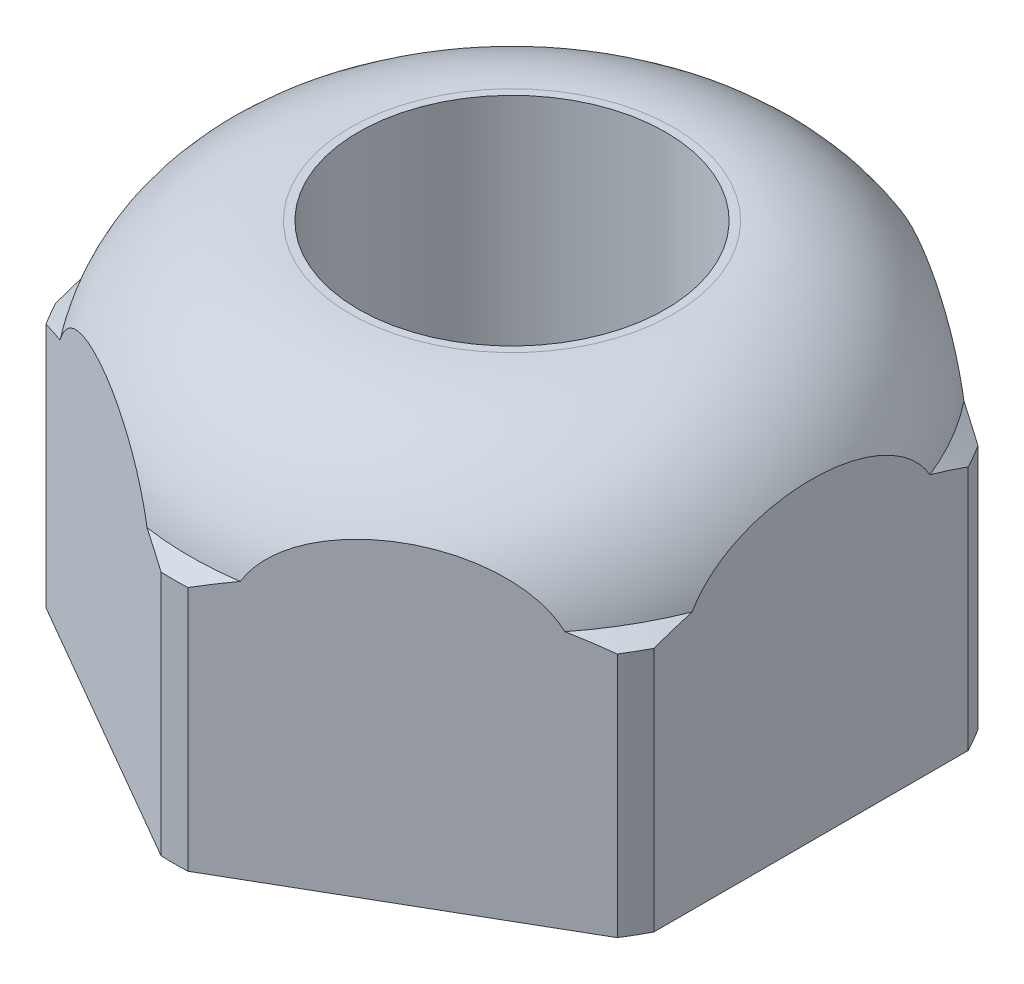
ISO-10303-21;
HEADER;
FILE_DESCRIPTION(('STEP AP214'),'2;1');
FILE_NAME('part.step','',(''),(''),'','','');
FILE_SCHEMA(('AUTOMOTIVE_DESIGN { 1 0 10303 214 1 1 1 1 }'));
ENDSEC;
DATA;
#1=APPLICATION_CONTEXT('core data for automotive mechanical design processes');
#2=APPLICATION_PROTOCOL_DEFINITION('international standard','automotive_design',2000,#1);
#3=PRODUCT_CONTEXT('',#1,'mechanical');
#4=PRODUCT('Part','Part','',(#3));
#5=PRODUCT_RELATED_PRODUCT_CATEGORY('part','',(#4));
#6=PRODUCT_DEFINITION_FORMATION('','',#4);
#7=PRODUCT_DEFINITION_CONTEXT('part definition',#1,'design');
#8=PRODUCT_DEFINITION('design','',#6,#7);
#9=PRODUCT_DEFINITION_SHAPE('','',#8);
#10=(LENGTH_UNIT() NAMED_UNIT(*) SI_UNIT(.MILLI.,.METRE.));
#11=(NAMED_UNIT(*) PLANE_ANGLE_UNIT() SI_UNIT($,.RADIAN.));
#12=(NAMED_UNIT(*) SI_UNIT($,.STERADIAN.) SOLID_ANGLE_UNIT());
#13=UNCERTAINTY_MEASURE_WITH_UNIT(LENGTH_MEASURE(1.E-05),#10,'distance_accuracy_value','');
#14=(GEOMETRIC_REPRESENTATION_CONTEXT(3) GLOBAL_UNCERTAINTY_ASSIGNED_CONTEXT((#13)) GLOBAL_UNIT_ASSIGNED_CONTEXT((#10,
#11,#12)) REPRESENTATION_CONTEXT('',''));
#15=CARTESIAN_POINT('',(0.,0.,0.));
#16=DIRECTION('',(0.,0.,1.));
#17=DIRECTION('',(1.,0.,0.));
#18=AXIS2_PLACEMENT_3D('',#15,#16,#17);
#19=CARTESIAN_POINT('',(0.,3.8608,0.));
#20=DIRECTION('',(0.,-1.,0.));
#21=DIRECTION('',(0.,0.,-1.));
#22=AXIS2_PLACEMENT_3D('',#19,#20,#21);
#23=CONICAL_SURFACE('',#22,5.3086,0.916536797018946);
#24=CARTESIAN_POINT('',(4.69899999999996,2.10487892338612,-5.97079744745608));
#25=CARTESIAN_POINT('',(4.69899999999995,2.19261307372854,-5.82519816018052));
#26=CARTESIAN_POINT('',(4.69899999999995,2.27947404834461,-5.67906509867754));
#27=CARTESIAN_POINT('',(4.69899999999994,2.4510707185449,-5.38552648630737));
#28=CARTESIAN_POINT('',(4.69899999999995,2.53580607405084,-5.23812073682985));
#29=CARTESIAN_POINT('',(4.69899999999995,2.70310471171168,-4.94123864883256));
#30=CARTESIAN_POINT('',(4.69899999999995,2.78565703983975,-4.79175611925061));
#31=CARTESIAN_POINT('',(4.69899999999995,2.94768125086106,-4.49113484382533));
#32=CARTESIAN_POINT('',(4.69899999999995,3.02715326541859,-4.33999616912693));
#33=CARTESIAN_POINT('',(4.69899999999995,3.18560333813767,-4.02948221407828));
#34=CARTESIAN_POINT('',(4.69899999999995,3.26442324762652,-3.87002588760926));
#35=CARTESIAN_POINT('',(4.69899999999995,3.41709379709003,-3.54875476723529));
#36=CARTESIAN_POINT('',(4.69899999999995,3.49094480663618,-3.3869401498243));
#37=CARTESIAN_POINT('',(4.69899999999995,3.63241723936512,-3.06087554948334));
#38=CARTESIAN_POINT('',(4.69899999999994,3.70004770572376,-2.89662951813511));
#39=CARTESIAN_POINT('',(4.69899999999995,3.82775308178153,-2.5652459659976));
#40=CARTESIAN_POINT('',(4.69899999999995,3.88782961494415,-2.39810907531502));
#41=CARTESIAN_POINT('',(4.69899999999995,4.00599735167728,-2.03866045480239));
#42=CARTESIAN_POINT('',(4.69899999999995,4.06279875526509,-1.84591774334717));
#43=CARTESIAN_POINT('',(4.69899999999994,4.16176897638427,-1.45665584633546));
#44=CARTESIAN_POINT('',(4.69899999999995,4.20393863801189,-1.26013687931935));
#45=CARTESIAN_POINT('',(4.69899999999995,4.27038638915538,-0.867108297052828));
#46=CARTESIAN_POINT('',(4.69899999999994,4.29492687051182,-0.670644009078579));
#47=CARTESIAN_POINT('',(4.69899999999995,4.32524162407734,-0.276265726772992));
#48=CARTESIAN_POINT('',(4.69899999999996,4.33101870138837,-0.0783519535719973));
#49=CARTESIAN_POINT('',(4.69899999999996,4.32330668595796,0.317688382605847));
#50=CARTESIAN_POINT('',(4.69899999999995,4.30975937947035,0.515813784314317));
#51=CARTESIAN_POINT('',(4.69899999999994,4.26442818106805,0.909955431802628));
#52=CARTESIAN_POINT('',(4.69899999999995,4.23264062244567,1.1059712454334));
#53=CARTESIAN_POINT('',(4.69899999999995,4.15253183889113,1.49765452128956));
#54=CARTESIAN_POINT('',(4.69899999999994,4.10396495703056,1.69327071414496));
#55=CARTESIAN_POINT('',(4.69899999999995,3.99328289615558,2.08057427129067));
#56=CARTESIAN_POINT('',(4.69899999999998,3.93116729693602,2.27226151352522));
#57=CARTESIAN_POINT('',(4.69899999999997,3.8076286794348,2.61933896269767));
#58=CARTESIAN_POINT('',(4.69899999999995,3.74789675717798,2.77534049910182));
#59=CARTESIAN_POINT('',(4.69899999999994,3.6222903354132,3.08486527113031));
#60=CARTESIAN_POINT('',(4.69899999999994,3.55641493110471,3.23838813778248));
#61=CARTESIAN_POINT('',(4.69899999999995,3.41956506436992,3.54332243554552));
#62=CARTESIAN_POINT('',(4.69899999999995,3.34858536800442,3.69473150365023));
#63=CARTESIAN_POINT('',(4.69899999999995,3.20248332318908,3.9955396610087));
#64=CARTESIAN_POINT('',(4.69899999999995,3.12736074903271,4.14493864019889));
#65=CARTESIAN_POINT('',(4.69899999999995,2.97666992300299,4.43622342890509));
#66=CARTESIAN_POINT('',(4.69899999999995,2.90123111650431,4.57817644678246));
#67=CARTESIAN_POINT('',(4.69899999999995,2.74771019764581,4.86064881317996));
#68=CARTESIAN_POINT('',(4.69899999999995,2.66962799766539,5.00116811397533));
#69=CARTESIAN_POINT('',(4.69899999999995,2.5114940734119,5.28050736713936));
#70=CARTESIAN_POINT('',(4.69899999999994,2.43144931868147,5.41933127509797));
#71=CARTESIAN_POINT('',(4.69899999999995,2.26948874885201,5.69586088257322));
#72=CARTESIAN_POINT('',(4.69899999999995,2.18757316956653,5.83356672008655));
#73=CARTESIAN_POINT('',(4.69899999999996,2.10487892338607,5.97079744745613));
#74=B_SPLINE_CURVE_WITH_KNOTS('',3,(#24,#25,#26,#27,#28,#29,#30,#31,#32,#33,#34,#35,#36,#37,#38,
#39,#40,#41,#42,#43,#44,#45,#46,#47,#48,#49,#50,#51,#52,#53,#54,#55,#56,#57,#58,#59,#60,#61,#62,
#63,#64,#65,#66,#67,#68,#69,#70,#71,#72,#73),.UNSPECIFIED.,.F.,.F.,(4,2,2,2,2,2,2,2,2,2,2,2,2,2,
2,2,2,2,2,2,2,2,2,2,4),(0.,0.509975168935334,1.02003141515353,1.53228922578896,2.04452511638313,
2.57807499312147,3.11158514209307,3.64430701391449,4.17691419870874,4.77925530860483,
5.38156166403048,5.97470633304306,6.56776232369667,7.16260864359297,7.7575745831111,
8.36164858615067,8.96574132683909,9.46673414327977,9.96780086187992,10.4693889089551,
10.971004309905,11.4532322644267,11.9354762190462,12.4162029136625,12.8968693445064),.UNSPECIFIED.);
#75=CARTESIAN_POINT('',(4.69899999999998,3.8608,-2.46994594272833));
#76=VERTEX_POINT('',#75);
#77=CARTESIAN_POINT('',(4.69899999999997,4.05412741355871,-1.86758009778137));
#78=VERTEX_POINT('',#77);
#79=EDGE_CURVE('E197',#76,#78,#74,.T.);
#80=ORIENTED_EDGE('',*,*,#79,.F.);
#81=CARTESIAN_POINT('',(0.,3.8608,0.));
#82=DIRECTION('',(0.,-1.,0.));
#83=DIRECTION('',(0.,0.,-1.));
#84=AXIS2_PLACEMENT_3D('',#81,#82,#83);
#85=CIRCLE('',#84,5.3086);
#86=CARTESIAN_POINT('',(4.48853593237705,3.8608,-2.83448040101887));
#87=VERTEX_POINT('',#86);
#88=EDGE_CURVE('E208',#87,#76,#85,.T.);
#89=ORIENTED_EDGE('',*,*,#88,.F.);
#90=CARTESIAN_POINT('',(-3.22322649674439,1.82124651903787,-7.28686851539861));
#91=CARTESIAN_POINT('',(-3.09899118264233,1.9100865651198,-7.21514122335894));
#92=CARTESIAN_POINT('',(-2.97436189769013,1.99820020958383,-7.14318647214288));
#93=CARTESIAN_POINT('',(-2.72417162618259,2.17267880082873,-6.99873905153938));
#94=CARTESIAN_POINT('',(-2.59861054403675,2.25904356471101,-6.92624632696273));
#95=CARTESIAN_POINT('',(-2.34608991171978,2.42994595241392,-6.78045347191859));
#96=CARTESIAN_POINT('',(-2.21912745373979,2.51447786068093,-6.70715166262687));
#97=CARTESIAN_POINT('',(-1.96399185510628,2.68106441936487,-6.55984905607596));
#98=CARTESIAN_POINT('',(-1.83581874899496,2.76311914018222,-6.48584827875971));
#99=CARTESIAN_POINT('',(-1.5723575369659,2.92783743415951,-6.33373887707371));
#100=CARTESIAN_POINT('',(-1.43700611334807,3.01036641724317,-6.25559369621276));
#101=CARTESIAN_POINT('',(-1.1645543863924,3.17147730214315,-6.09829361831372));
#102=CARTESIAN_POINT('',(-1.0274541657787,3.25005938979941,-6.01913876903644));
#103=CARTESIAN_POINT('',(-0.75136974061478,3.40231749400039,-5.85974135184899));
#104=CARTESIAN_POINT('',(-0.612387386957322,3.47599796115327,-5.77949985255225));
#105=CARTESIAN_POINT('',(-0.332178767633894,3.61739880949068,-5.6177213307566));
#106=CARTESIAN_POINT('',(-0.190952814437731,3.68512001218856,-5.53618448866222));
#107=CARTESIAN_POINT('',(0.117503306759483,3.8238023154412,-5.35809726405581));
#108=CARTESIAN_POINT('',(0.285180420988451,3.8934553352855,-5.2612888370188));
#109=CARTESIAN_POINT('',(0.624123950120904,4.02015430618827,-5.06559969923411));
#110=CARTESIAN_POINT('',(0.795390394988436,4.07720015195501,-4.96671897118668));
#111=CARTESIAN_POINT('',(1.13853405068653,4.17485746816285,-4.76860488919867));
#112=CARTESIAN_POINT('',(1.31035680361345,4.21571929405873,-4.66940297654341));
#113=CARTESIAN_POINT('',(1.65649983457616,4.27951817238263,-4.46955720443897));
#114=CARTESIAN_POINT('',(1.83081955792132,4.30245914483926,-4.36891366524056));
#115=CARTESIAN_POINT('',(2.18244221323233,4.32866530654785,-4.16590423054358));
#116=CARTESIAN_POINT('',(2.35975722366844,4.33172059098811,-4.06353136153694));
#117=CARTESIAN_POINT('',(2.71375542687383,4.31731492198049,-3.85915040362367));
#118=CARTESIAN_POINT('',(2.89043857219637,4.2998524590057,-3.75714234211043));
#119=CARTESIAN_POINT('',(3.24455878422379,4.24548221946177,-3.55269094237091));
#120=CARTESIAN_POINT('',(3.42195735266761,4.20824801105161,-3.45026983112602));
#121=CARTESIAN_POINT('',(3.77342835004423,4.11698536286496,-3.24734795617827));
#122=CARTESIAN_POINT('',(3.94750047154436,4.06295537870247,-3.14684736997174));
#123=CARTESIAN_POINT('',(4.29332312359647,3.94079447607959,-2.94718656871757));
#124=CARTESIAN_POINT('',(4.46504482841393,3.87255652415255,-2.84804299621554));
#125=CARTESIAN_POINT('',(4.804965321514,3.72515032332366,-2.65178980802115));
#126=CARTESIAN_POINT('',(4.97316267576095,3.64597772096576,-2.55468102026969));
#127=CARTESIAN_POINT('',(5.30676822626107,3.47890777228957,-2.36207376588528));
#128=CARTESIAN_POINT('',(5.47216798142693,3.39098815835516,-2.26658017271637));
#129=CARTESIAN_POINT('',(5.80014192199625,3.2084923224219,-2.0772243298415));
#130=CARTESIAN_POINT('',(5.96271650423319,3.11391704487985,-1.9833618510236));
#131=CARTESIAN_POINT('',(6.27797101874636,2.92405492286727,-1.80134957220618));
#132=CARTESIAN_POINT('',(6.43075914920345,2.82900634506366,-1.7131373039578));
#133=CARTESIAN_POINT('',(6.73450885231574,2.63508168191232,-1.53776733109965));
#134=CARTESIAN_POINT('',(6.88547031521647,2.53620536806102,-1.45060968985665));
#135=CARTESIAN_POINT('',(7.1848166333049,2.33604742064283,-1.27778201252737));
#136=CARTESIAN_POINT('',(7.33321203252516,2.23478674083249,-1.19210588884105));
#137=CARTESIAN_POINT('',(7.62866160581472,2.02976506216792,-1.02152799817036));
#138=CARTESIAN_POINT('',(7.77571604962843,1.92600458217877,-0.936626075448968));
#139=CARTESIAN_POINT('',(7.92222649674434,1.82124651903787,-0.852038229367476));
#140=B_SPLINE_CURVE_WITH_KNOTS('',3,(#90,#91,#92,#93,#94,#95,#96,#97,#98,#99,#100,#101,#102,
#103,#104,#105,#106,#107,#108,#109,#110,#111,#112,#113,#114,#115,#116,#117,#118,#119,#120,#121,
#122,#123,#124,#125,#126,#127,#128,#129,#130,#131,#132,#133,#134,#135,#136,#137,#138,#139),
.UNSPECIFIED.,.F.,.F.,(4,2,2,2,2,2,2,2,2,2,2,2,2,2,2,2,2,2,2,2,2,2,2,2,4),(0.,0.506211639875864,
1.01247594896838,1.52014078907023,2.02779118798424,2.55797090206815,3.08812562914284,
3.61779222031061,4.14738567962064,4.76433306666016,5.38128560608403,5.98828200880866,
6.59514559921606,7.20840473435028,7.82170899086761,8.44546896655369,9.06928631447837,
9.69798512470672,10.3269349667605,10.9575290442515,11.5880338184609,12.1891748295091,
12.7903517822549,13.3874366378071,13.9843986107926),.UNSPECIFIED.);
#141=CARTESIAN_POINT('',(3.96687180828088,4.05412741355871,-3.13566332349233));
#142=VERTEX_POINT('',#141);
#143=EDGE_CURVE('E276',#142,#87,#140,.T.);
#144=ORIENTED_EDGE('',*,*,#143,.F.);
#145=CARTESIAN_POINT('',(0.,4.05412741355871,0.));
#146=DIRECTION('',(0.,-1.,0.));
#147=DIRECTION('',(0.,0.,-1.));
#148=AXIS2_PLACEMENT_3D('',#145,#146,#147);
#149=CIRCLE('',#148,5.05652612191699);
#150=EDGE_CURVE('E213',#142,#78,#149,.T.);
#151=ORIENTED_EDGE('',*,*,#150,.T.);
#152=EDGE_LOOP('',(#80,#89,#144,#151));
#153=FACE_BOUND('',#152,.T.);
#154=ADVANCED_FACE('F36',(#153),#23,.T.);
#155=CARTESIAN_POINT('',(0.210464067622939,3.8608,-5.30442634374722));
#156=VERTEX_POINT('',#155);
#157=CARTESIAN_POINT('',(0.732128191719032,4.05412741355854,-5.00324342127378));
#158=VERTEX_POINT('',#157);
#159=EDGE_CURVE('E281',#156,#158,#140,.T.);
#160=ORIENTED_EDGE('',*,*,#159,.F.);
#161=CARTESIAN_POINT('',(-0.210464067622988,3.8608,-5.30442634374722));
#162=VERTEX_POINT('',#161);
#163=EDGE_CURVE('E204',#162,#156,#85,.T.);
#164=ORIENTED_EDGE('',*,*,#163,.F.);
#165=CARTESIAN_POINT('',(-7.92222649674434,1.82124651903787,-0.85203822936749));
#166=CARTESIAN_POINT('',(-7.79799118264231,1.91008656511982,-0.923765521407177));
#167=CARTESIAN_POINT('',(-7.67336189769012,1.99820020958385,-0.995720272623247));
#168=CARTESIAN_POINT('',(-7.42317162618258,2.17267880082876,-1.14016769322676));
#169=CARTESIAN_POINT('',(-7.29761054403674,2.25904356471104,-1.2126604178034));
#170=CARTESIAN_POINT('',(-7.04508991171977,2.42994595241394,-1.35845327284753));
#171=CARTESIAN_POINT('',(-6.91812745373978,2.51447786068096,-1.43175508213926));
#172=CARTESIAN_POINT('',(-6.66299185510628,2.6810644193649,-1.57905768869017));
#173=CARTESIAN_POINT('',(-6.53481874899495,2.76311914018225,-1.65305846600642));
#174=CARTESIAN_POINT('',(-6.27135753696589,2.92783743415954,-1.80516786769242));
#175=CARTESIAN_POINT('',(-6.13600611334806,3.01036641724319,-1.88331304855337));
#176=CARTESIAN_POINT('',(-5.86355438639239,3.17147730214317,-2.04061312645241));
#177=CARTESIAN_POINT('',(-5.72645416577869,3.25005938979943,-2.11976797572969));
#178=CARTESIAN_POINT('',(-5.45036974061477,3.40231749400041,-2.27916539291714));
#179=CARTESIAN_POINT('',(-5.31138738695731,3.47599796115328,-2.35940689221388));
#180=CARTESIAN_POINT('',(-5.03117876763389,3.6173988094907,-2.52118541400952));
#181=CARTESIAN_POINT('',(-4.88995281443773,3.68512001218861,-2.60272225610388));
#182=CARTESIAN_POINT('',(-4.58149669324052,3.82380231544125,-2.78080948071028));
#183=CARTESIAN_POINT('',(-4.41381957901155,3.89345533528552,-2.87761790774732));
#184=CARTESIAN_POINT('',(-4.0748760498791,4.02015430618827,-3.07330704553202));
#185=CARTESIAN_POINT('',(-3.90360960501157,4.07720015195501,-3.17218777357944));
#186=CARTESIAN_POINT('',(-3.56046594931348,4.17485746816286,-3.37030185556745));
#187=CARTESIAN_POINT('',(-3.38864319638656,4.21571929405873,-3.46950376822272));
#188=CARTESIAN_POINT('',(-3.04250016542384,4.27951817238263,-3.66934954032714));
#189=CARTESIAN_POINT('',(-2.86818044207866,4.30245914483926,-3.76999307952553));
#190=CARTESIAN_POINT('',(-2.51655778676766,4.32866530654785,-3.97300251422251));
#191=CARTESIAN_POINT('',(-2.33924277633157,4.3317205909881,-4.07537538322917));
#192=CARTESIAN_POINT('',(-1.98524457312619,4.31731492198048,-4.27975634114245));
#193=CARTESIAN_POINT('',(-1.80856142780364,4.29985245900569,-4.38176440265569));
#194=CARTESIAN_POINT('',(-1.45444121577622,4.24548221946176,-4.58621580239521));
#195=CARTESIAN_POINT('',(-1.27704264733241,4.2082480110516,-4.6886369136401));
#196=CARTESIAN_POINT('',(-0.925571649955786,4.11698536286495,-4.89155878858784));
#197=CARTESIAN_POINT('',(-0.751499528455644,4.06295537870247,-4.99205937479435));
#198=CARTESIAN_POINT('',(-0.405676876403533,3.94079447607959,-5.19172017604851));
#199=CARTESIAN_POINT('',(-0.233955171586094,3.87255652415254,-5.29086374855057));
#200=CARTESIAN_POINT('',(0.105965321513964,3.72515032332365,-5.48711693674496));
#201=CARTESIAN_POINT('',(0.274162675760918,3.64597772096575,-5.58422572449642));
#202=CARTESIAN_POINT('',(0.607768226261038,3.47890777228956,-5.77683297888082));
#203=CARTESIAN_POINT('',(0.773167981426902,3.39098815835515,-5.87232657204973));
#204=CARTESIAN_POINT('',(1.10114192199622,3.2084923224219,-6.06168241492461));
#205=CARTESIAN_POINT('',(1.26371650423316,3.11391704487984,-6.1555448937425));
#206=CARTESIAN_POINT('',(1.57897101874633,2.92405492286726,-6.33755717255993));
#207=CARTESIAN_POINT('',(1.73175914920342,2.82900634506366,-6.42576944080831));
#208=CARTESIAN_POINT('',(2.03550885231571,2.63508168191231,-6.60113941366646));
#209=CARTESIAN_POINT('',(2.18647031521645,2.53620536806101,-6.68829705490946));
#210=CARTESIAN_POINT('',(2.48581663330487,2.33604742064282,-6.86112473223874));
#211=CARTESIAN_POINT('',(2.63421203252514,2.23478674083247,-6.94680085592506));
#212=CARTESIAN_POINT('',(2.9296616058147,2.02976506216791,-7.11737874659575));
#213=CARTESIAN_POINT('',(3.07671604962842,1.92600458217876,-7.20228066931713));
#214=CARTESIAN_POINT('',(3.22322649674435,1.82124651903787,-7.28686851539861));
#215=B_SPLINE_CURVE_WITH_KNOTS('',3,(#165,#166,#167,#168,#169,#170,#171,#172,#173,#174,#175,
#176,#177,#178,#179,#180,#181,#182,#183,#184,#185,#186,#187,#188,#189,#190,#191,#192,#193,#194,
#195,#196,#197,#198,#199,#200,#201,#202,#203,#204,#205,#206,#207,#208,#209,#210,#211,#212,#213,
#214),.UNSPECIFIED.,.F.,.F.,(4,2,2,2,2,2,2,2,2,2,2,2,2,2,2,2,2,2,2,2,2,2,2,2,4),(0.,
0.506211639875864,1.01247594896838,1.52014078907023,2.02779118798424,2.55797090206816,
3.08812562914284,3.6177922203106,4.14738567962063,4.76433306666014,5.38128560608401,
5.98828200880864,6.59514559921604,7.20840473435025,7.82170899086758,8.44546896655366,
9.06928631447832,9.69798512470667,10.3269349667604,10.9575290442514,11.5880338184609,
12.189174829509,12.7903517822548,13.3874366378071,13.9843986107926),.UNSPECIFIED.);
#216=CARTESIAN_POINT('',(-0.732128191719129,4.05412741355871,-5.00324342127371));
#217=VERTEX_POINT('',#216);
#218=EDGE_CURVE('E51',#217,#162,#215,.T.);
#219=ORIENTED_EDGE('',*,*,#218,.F.);
#220=EDGE_CURVE('E209',#217,#158,#149,.T.);
#221=ORIENTED_EDGE('',*,*,#220,.T.);
#222=EDGE_LOOP('',(#160,#164,#219,#221));
#223=FACE_BOUND('',#222,.T.);
#224=ADVANCED_FACE('F388',(#223),#23,.T.);
#225=CARTESIAN_POINT('',(-4.48853593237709,3.8608,-2.83448040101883));
#226=VERTEX_POINT('',#225);
#227=CARTESIAN_POINT('',(-3.96687180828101,4.05412741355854,-3.13566332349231));
#228=VERTEX_POINT('',#227);
#229=EDGE_CURVE('E274',#226,#228,#215,.T.);
#230=ORIENTED_EDGE('',*,*,#229,.F.);
#231=CARTESIAN_POINT('',(-4.69899999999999,3.8608,-2.46994594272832));
#232=VERTEX_POINT('',#231);
#233=EDGE_CURVE('E207',#232,#226,#85,.T.);
#234=ORIENTED_EDGE('',*,*,#233,.F.);
#235=CARTESIAN_POINT('',(-4.69899999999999,2.10487892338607,5.97079744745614));
#236=CARTESIAN_POINT('',(-4.69899999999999,2.19261307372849,5.82519816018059));
#237=CARTESIAN_POINT('',(-4.69899999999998,2.27947404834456,5.67906509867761));
#238=CARTESIAN_POINT('',(-4.69899999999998,2.45107071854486,5.38552648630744));
#239=CARTESIAN_POINT('',(-4.69899999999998,2.5358060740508,5.23812073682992));
#240=CARTESIAN_POINT('',(-4.69899999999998,2.70310471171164,4.94123864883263));
#241=CARTESIAN_POINT('',(-4.69899999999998,2.78565703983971,4.79175611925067));
#242=CARTESIAN_POINT('',(-4.69899999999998,2.94768125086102,4.49113484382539));
#243=CARTESIAN_POINT('',(-4.69899999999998,3.02715326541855,4.33999616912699));
#244=CARTESIAN_POINT('',(-4.69899999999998,3.18560333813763,4.02948221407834));
#245=CARTESIAN_POINT('',(-4.69899999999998,3.26442324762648,3.87002588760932));
#246=CARTESIAN_POINT('',(-4.69899999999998,3.41709379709,3.54875476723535));
#247=CARTESIAN_POINT('',(-4.69899999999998,3.49094480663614,3.38694014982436));
#248=CARTESIAN_POINT('',(-4.69899999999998,3.63241723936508,3.0608755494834));
#249=CARTESIAN_POINT('',(-4.69899999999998,3.70004770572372,2.89662951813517));
#250=CARTESIAN_POINT('',(-4.69899999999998,3.82775308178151,2.56524596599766));
#251=CARTESIAN_POINT('',(-4.69899999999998,3.88782961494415,2.39810907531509));
#252=CARTESIAN_POINT('',(-4.69899999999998,4.00599735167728,2.03866045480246));
#253=CARTESIAN_POINT('',(-4.69899999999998,4.06279875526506,1.84591774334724));
#254=CARTESIAN_POINT('',(-4.69899999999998,4.16176897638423,1.45665584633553));
#255=CARTESIAN_POINT('',(-4.69899999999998,4.20393863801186,1.26013687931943));
#256=CARTESIAN_POINT('',(-4.69899999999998,4.27038638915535,0.867108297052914));
#257=CARTESIAN_POINT('',(-4.69899999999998,4.29492687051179,0.670644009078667));
#258=CARTESIAN_POINT('',(-4.69899999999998,4.32524162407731,0.276265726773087));
#259=CARTESIAN_POINT('',(-4.69899999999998,4.33101870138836,0.0783519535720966));
#260=CARTESIAN_POINT('',(-4.69899999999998,4.32330668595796,-0.317688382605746));
#261=CARTESIAN_POINT('',(-4.69899999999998,4.30975937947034,-0.515813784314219));
#262=CARTESIAN_POINT('',(-4.69899999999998,4.26442818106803,-0.909955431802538));
#263=CARTESIAN_POINT('',(-4.69899999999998,4.23264062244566,-1.10597124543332));
#264=CARTESIAN_POINT('',(-4.69899999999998,4.15253183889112,-1.49765452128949));
#265=CARTESIAN_POINT('',(-4.69899999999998,4.10396495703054,-1.69327071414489));
#266=CARTESIAN_POINT('',(-4.69899999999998,3.99328289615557,-2.08057427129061));
#267=CARTESIAN_POINT('',(-4.69899999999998,3.93116729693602,-2.27226151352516));
#268=CARTESIAN_POINT('',(-4.69899999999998,3.8076286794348,-2.61933896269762));
#269=CARTESIAN_POINT('',(-4.69899999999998,3.74789675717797,-2.77534049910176));
#270=CARTESIAN_POINT('',(-4.69899999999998,3.62229033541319,-3.08486527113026));
#271=CARTESIAN_POINT('',(-4.69899999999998,3.55641493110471,-3.23838813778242));
#272=CARTESIAN_POINT('',(-4.69899999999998,3.41956506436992,-3.54332243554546));
#273=CARTESIAN_POINT('',(-4.69899999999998,3.34858536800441,-3.69473150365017));
#274=CARTESIAN_POINT('',(-4.69899999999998,3.20248332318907,-3.99553966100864));
#275=CARTESIAN_POINT('',(-4.69899999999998,3.1273607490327,-4.14493864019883));
#276=CARTESIAN_POINT('',(-4.69899999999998,2.97666992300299,-4.43622342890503));
#277=CARTESIAN_POINT('',(-4.69899999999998,2.90123111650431,-4.57817644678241));
#278=CARTESIAN_POINT('',(-4.69899999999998,2.74771019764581,-4.86064881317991));
#279=CARTESIAN_POINT('',(-4.69899999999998,2.66962799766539,-5.00116811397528));
#280=CARTESIAN_POINT('',(-4.69899999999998,2.5114940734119,-5.28050736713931));
#281=CARTESIAN_POINT('',(-4.69899999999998,2.43144931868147,-5.41933127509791));
#282=CARTESIAN_POINT('',(-4.69899999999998,2.26948874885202,-5.69586088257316));
#283=CARTESIAN_POINT('',(-4.69899999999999,2.18757316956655,-5.8335667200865));
#284=CARTESIAN_POINT('',(-4.69900000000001,2.10487892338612,-5.97079744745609));
#285=B_SPLINE_CURVE_WITH_KNOTS('',3,(#235,#236,#237,#238,#239,#240,#241,#242,#243,#244,#245,
#246,#247,#248,#249,#250,#251,#252,#253,#254,#255,#256,#257,#258,#259,#260,#261,#262,#263,#264,
#265,#266,#267,#268,#269,#270,#271,#272,#273,#274,#275,#276,#277,#278,#279,#280,#281,#282,#283,
#284),.UNSPECIFIED.,.F.,.F.,(4,2,2,2,2,2,2,2,2,2,2,2,2,2,2,2,2,2,2,2,2,2,2,2,4),(0.,
0.509975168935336,1.02003141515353,1.53228922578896,2.04452511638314,2.57807499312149,
3.11158514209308,3.64430701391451,4.17691419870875,4.77925530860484,5.38156166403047,
5.97470633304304,6.56776232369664,7.16260864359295,7.75757458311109,8.36164858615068,
8.96574132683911,9.46673414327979,9.96780086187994,10.4693889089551,10.971004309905,
11.4532322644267,11.9354762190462,12.4162029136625,12.8968693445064),.UNSPECIFIED.);
#286=CARTESIAN_POINT('',(-4.69899999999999,4.05412741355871,-1.86758009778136));
#287=VERTEX_POINT('',#286);
#288=EDGE_CURVE('E59',#287,#232,#285,.T.);
#289=ORIENTED_EDGE('',*,*,#288,.F.);
#290=EDGE_CURVE('E212',#287,#228,#149,.T.);
#291=ORIENTED_EDGE('',*,*,#290,.T.);
#292=EDGE_LOOP('',(#230,#234,#289,#291));
#293=FACE_BOUND('',#292,.T.);
#294=ADVANCED_FACE('F271',(#293),#23,.T.);
#295=CARTESIAN_POINT('',(-4.69900000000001,3.8608,2.46994594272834));
#296=VERTEX_POINT('',#295);
#297=CARTESIAN_POINT('',(-4.69900000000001,4.05412741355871,1.86758009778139));
#298=VERTEX_POINT('',#297);
#299=EDGE_CURVE('E289',#296,#298,#285,.T.);
#300=ORIENTED_EDGE('',*,*,#299,.F.);
#301=CARTESIAN_POINT('',(-4.48853593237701,3.8608,2.83448040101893));
#302=VERTEX_POINT('',#301);
#303=EDGE_CURVE('E259',#302,#296,#85,.T.);
#304=ORIENTED_EDGE('',*,*,#303,.F.);
#305=CARTESIAN_POINT('',(3.22322649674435,1.82124651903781,7.28686851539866));
#306=CARTESIAN_POINT('',(3.09899118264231,1.91008656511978,7.21514122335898));
#307=CARTESIAN_POINT('',(2.97436189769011,1.99820020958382,7.14318647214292));
#308=CARTESIAN_POINT('',(2.72417162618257,2.17267880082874,6.99873905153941));
#309=CARTESIAN_POINT('',(2.59861054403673,2.25904356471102,6.92624632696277));
#310=CARTESIAN_POINT('',(2.34608991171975,2.42994595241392,6.78045347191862));
#311=CARTESIAN_POINT('',(2.21912745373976,2.51447786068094,6.7071516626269));
#312=CARTESIAN_POINT('',(1.96399185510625,2.68106441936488,6.55984905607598));
#313=CARTESIAN_POINT('',(1.83581874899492,2.76311914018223,6.48584827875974));
#314=CARTESIAN_POINT('',(1.57235753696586,2.92783743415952,6.33373887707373));
#315=CARTESIAN_POINT('',(1.43700611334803,3.01036641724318,6.25559369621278));
#316=CARTESIAN_POINT('',(1.16455438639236,3.17147730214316,6.09829361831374));
#317=CARTESIAN_POINT('',(1.02745416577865,3.25005938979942,6.01913876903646));
#318=CARTESIAN_POINT('',(0.751369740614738,3.4023174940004,5.85974135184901));
#319=CARTESIAN_POINT('',(0.612387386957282,3.47599796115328,5.77949985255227));
#320=CARTESIAN_POINT('',(0.332178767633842,3.61739880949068,5.61772133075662));
#321=CARTESIAN_POINT('',(0.190952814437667,3.68512001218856,5.53618448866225));
#322=CARTESIAN_POINT('',(-0.117503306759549,3.82380231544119,5.35809726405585));
#323=CARTESIAN_POINT('',(-0.285180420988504,3.8934553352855,5.26128883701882));
#324=CARTESIAN_POINT('',(-0.624123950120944,4.02015430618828,5.06559969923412));
#325=CARTESIAN_POINT('',(-0.795390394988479,4.07720015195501,4.9667189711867));
#326=CARTESIAN_POINT('',(-1.13853405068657,4.17485746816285,4.76860488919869));
#327=CARTESIAN_POINT('',(-1.31035680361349,4.21571929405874,4.66940297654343));
#328=CARTESIAN_POINT('',(-1.6564998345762,4.27951817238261,4.469557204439));
#329=CARTESIAN_POINT('',(-1.83081955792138,4.30245914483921,4.3689136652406));
#330=CARTESIAN_POINT('',(-2.18244221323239,4.32866530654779,4.16590423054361));
#331=CARTESIAN_POINT('',(-2.35975722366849,4.33172059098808,4.06353136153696));
#332=CARTESIAN_POINT('',(-2.71375542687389,4.31731492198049,3.85915040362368));
#333=CARTESIAN_POINT('',(-2.89043857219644,4.29985245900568,3.75714234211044));
#334=CARTESIAN_POINT('',(-3.24455878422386,4.24548221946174,3.55269094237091));
#335=CARTESIAN_POINT('',(-3.42195735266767,4.20824801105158,3.45026983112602));
#336=CARTESIAN_POINT('',(-3.77342835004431,4.11698536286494,3.24734795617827));
#337=CARTESIAN_POINT('',(-3.94750047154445,4.06295537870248,3.14684736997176));
#338=CARTESIAN_POINT('',(-4.29332312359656,3.94079447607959,2.9471865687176));
#339=CARTESIAN_POINT('',(-4.46504482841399,3.87255652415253,2.84804299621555));
#340=CARTESIAN_POINT('',(-4.80496532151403,3.72515032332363,2.65178980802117));
#341=CARTESIAN_POINT('',(-4.97316267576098,3.64597772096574,2.55468102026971));
#342=CARTESIAN_POINT('',(-5.30676822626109,3.47890777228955,2.36207376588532));
#343=CARTESIAN_POINT('',(-5.47216798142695,3.39098815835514,2.26658017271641));
#344=CARTESIAN_POINT('',(-5.80014192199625,3.2084923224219,2.07722432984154));
#345=CARTESIAN_POINT('',(-5.96271650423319,3.11391704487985,1.98336185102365));
#346=CARTESIAN_POINT('',(-6.27797101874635,2.92405492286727,1.80134957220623));
#347=CARTESIAN_POINT('',(-6.43075914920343,2.82900634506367,1.71313730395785));
#348=CARTESIAN_POINT('',(-6.73450885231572,2.63508168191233,1.5377673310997));
#349=CARTESIAN_POINT('',(-6.88547031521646,2.53620536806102,1.4506096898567));
#350=CARTESIAN_POINT('',(-7.18481663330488,2.33604742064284,1.27778201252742));
#351=CARTESIAN_POINT('',(-7.33321203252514,2.2347867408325,1.1921058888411));
#352=CARTESIAN_POINT('',(-7.6286616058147,2.02976506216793,1.02152799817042));
#353=CARTESIAN_POINT('',(-7.77571604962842,1.92600458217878,0.936626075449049));
#354=CARTESIAN_POINT('',(-7.92222649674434,1.82124651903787,0.852038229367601));
#355=B_SPLINE_CURVE_WITH_KNOTS('',3,(#305,#306,#307,#308,#309,#310,#311,#312,#313,#314,#315,
#316,#317,#318,#319,#320,#321,#322,#323,#324,#325,#326,#327,#328,#329,#330,#331,#332,#333,#334,
#335,#336,#337,#338,#339,#340,#341,#342,#343,#344,#345,#346,#347,#348,#349,#350,#351,#352,#353,
#354),.UNSPECIFIED.,.F.,.F.,(4,2,2,2,2,2,2,2,2,2,2,2,2,2,2,2,2,2,2,2,2,2,2,2,4),(0.,
0.506211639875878,1.0124759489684,1.52014078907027,2.02779118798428,2.5579709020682,
3.08812562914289,3.61779222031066,4.1473856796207,4.76433306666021,5.38128560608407,
5.9882820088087,6.5951455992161,7.20840473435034,7.82170899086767,8.44546896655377,
9.06928631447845,9.69798512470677,10.3269349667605,10.9575290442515,11.5880338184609,
12.189174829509,12.7903517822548,13.3874366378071,13.9843986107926),.UNSPECIFIED.);
#356=CARTESIAN_POINT('',(-3.96687180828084,4.05412741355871,3.13566332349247));
#357=VERTEX_POINT('',#356);
#358=EDGE_CURVE('E302',#357,#302,#355,.T.);
#359=ORIENTED_EDGE('',*,*,#358,.F.);
#360=EDGE_CURVE('E418',#357,#298,#149,.T.);
#361=ORIENTED_EDGE('',*,*,#360,.T.);
#362=EDGE_LOOP('',(#300,#304,#359,#361));
#363=FACE_BOUND('',#362,.T.);
#364=ADVANCED_FACE('F416',(#363),#23,.T.);
#365=CARTESIAN_POINT('',(-0.210464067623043,3.8608,5.30442634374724));
#366=VERTEX_POINT('',#365);
#367=CARTESIAN_POINT('',(-0.732128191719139,4.05412741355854,5.00324342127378));
#368=VERTEX_POINT('',#367);
#369=EDGE_CURVE('E299',#366,#368,#355,.T.);
#370=ORIENTED_EDGE('',*,*,#369,.F.);
#371=CARTESIAN_POINT('',(0.210464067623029,3.8608,5.30442634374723));
#372=VERTEX_POINT('',#371);
#373=EDGE_CURVE('E257',#372,#366,#85,.T.);
#374=ORIENTED_EDGE('',*,*,#373,.F.);
#375=CARTESIAN_POINT('',(7.92222649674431,1.82124651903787,0.852038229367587));
#376=CARTESIAN_POINT('',(7.79799118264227,1.91008656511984,0.923765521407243));
#377=CARTESIAN_POINT('',(7.67336189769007,1.99820020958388,0.995720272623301));
#378=CARTESIAN_POINT('',(7.42317162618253,2.1726788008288,1.1401676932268));
#379=CARTESIAN_POINT('',(7.29761054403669,2.25904356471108,1.21266041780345));
#380=CARTESIAN_POINT('',(7.04508991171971,2.42994595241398,1.35845327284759));
#381=CARTESIAN_POINT('',(6.91812745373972,2.514477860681,1.43175508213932));
#382=CARTESIAN_POINT('',(6.66299185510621,2.68106441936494,1.57905768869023));
#383=CARTESIAN_POINT('',(6.53481874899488,2.76311914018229,1.65305846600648));
#384=CARTESIAN_POINT('',(6.27135753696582,2.92783743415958,1.80516786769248));
#385=CARTESIAN_POINT('',(6.13600611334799,3.01036641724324,1.88331304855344));
#386=CARTESIAN_POINT('',(5.86355438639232,3.17147730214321,2.04061312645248));
#387=CARTESIAN_POINT('',(5.72645416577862,3.25005938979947,2.11976797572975));
#388=CARTESIAN_POINT('',(5.4503697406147,3.40231749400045,2.2791653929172));
#389=CARTESIAN_POINT('',(5.31138738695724,3.47599796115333,2.35940689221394));
#390=CARTESIAN_POINT('',(5.03117876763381,3.61739880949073,2.52118541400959));
#391=CARTESIAN_POINT('',(4.88995281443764,3.68512001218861,2.60272225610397));
#392=CARTESIAN_POINT('',(4.58149669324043,3.82380231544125,2.78080948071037));
#393=CARTESIAN_POINT('',(4.41381957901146,3.89345533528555,2.87761790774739));
#394=CARTESIAN_POINT('',(4.07487604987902,4.02015430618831,3.07330704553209));
#395=CARTESIAN_POINT('',(3.90360960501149,4.07720015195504,3.17218777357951));
#396=CARTESIAN_POINT('',(3.5604659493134,4.17485746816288,3.37030185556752));
#397=CARTESIAN_POINT('',(3.38864319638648,4.21571929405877,3.46950376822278));
#398=CARTESIAN_POINT('',(3.04250016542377,4.27951817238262,3.66934954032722));
#399=CARTESIAN_POINT('',(2.8681804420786,4.30245914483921,3.76999307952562));
#400=CARTESIAN_POINT('',(2.51655778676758,4.32866530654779,3.97300251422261));
#401=CARTESIAN_POINT('',(2.33924277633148,4.33172059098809,4.07537538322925));
#402=CARTESIAN_POINT('',(1.98524457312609,4.3173149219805,4.27975634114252));
#403=CARTESIAN_POINT('',(1.80856142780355,4.29985245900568,4.38176440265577));
#404=CARTESIAN_POINT('',(1.45444121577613,4.24548221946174,4.58621580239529));
#405=CARTESIAN_POINT('',(1.27704264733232,4.20824801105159,4.68863691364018));
#406=CARTESIAN_POINT('',(0.925571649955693,4.11698536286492,4.89155878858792));
#407=CARTESIAN_POINT('',(0.751499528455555,4.06295537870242,4.99205937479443));
#408=CARTESIAN_POINT('',(0.405676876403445,3.94079447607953,5.19172017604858));
#409=CARTESIAN_POINT('',(0.233955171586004,3.8725565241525,5.29086374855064));
#410=CARTESIAN_POINT('',(-0.105965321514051,3.72515032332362,5.48711693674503));
#411=CARTESIAN_POINT('',(-0.274162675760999,3.64597772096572,5.58422572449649));
#412=CARTESIAN_POINT('',(-0.607768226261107,3.47890777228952,5.77683297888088));
#413=CARTESIAN_POINT('',(-0.773167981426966,3.39098815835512,5.87232657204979));
#414=CARTESIAN_POINT('',(-1.10114192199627,3.20849232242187,6.06168241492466));
#415=CARTESIAN_POINT('',(-1.26371650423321,3.11391704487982,6.15554489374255));
#416=CARTESIAN_POINT('',(-1.57897101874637,2.92405492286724,6.33755717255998));
#417=CARTESIAN_POINT('',(-1.73175914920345,2.82900634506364,6.42576944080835));
#418=CARTESIAN_POINT('',(-2.03550885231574,2.6350816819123,6.6011394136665));
#419=CARTESIAN_POINT('',(-2.18647031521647,2.53620536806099,6.6882970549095));
#420=CARTESIAN_POINT('',(-2.4858166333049,2.33604742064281,6.86112473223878));
#421=CARTESIAN_POINT('',(-2.63421203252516,2.23478674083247,6.9468008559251));
#422=CARTESIAN_POINT('',(-2.92966160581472,2.02976506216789,7.11737874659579));
#423=CARTESIAN_POINT('',(-3.07671604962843,1.92600458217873,7.20228066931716));
#424=CARTESIAN_POINT('',(-3.22322649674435,1.82124651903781,7.28686851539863));
#425=B_SPLINE_CURVE_WITH_KNOTS('',3,(#375,#376,#377,#378,#379,#380,#381,#382,#383,#384,#385,
#386,#387,#388,#389,#390,#391,#392,#393,#394,#395,#396,#397,#398,#399,#400,#401,#402,#403,#404,
#405,#406,#407,#408,#409,#410,#411,#412,#413,#414,#415,#416,#417,#418,#419,#420,#421,#422,#423,
#424),.UNSPECIFIED.,.F.,.F.,(4,2,2,2,2,2,2,2,2,2,2,2,2,2,2,2,2,2,2,2,2,2,2,2,4),(0.,
0.506211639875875,1.0124759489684,1.52014078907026,2.02779118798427,2.55797090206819,
3.08812562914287,3.61779222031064,4.14738567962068,4.76433306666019,5.38128560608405,
5.98828200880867,6.59514559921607,7.2084047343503,7.82170899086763,8.44546896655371,
9.06928631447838,9.69798512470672,10.3269349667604,10.9575290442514,11.5880338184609,
12.189174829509,12.7903517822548,13.387436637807,13.9843986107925),.UNSPECIFIED.);
#426=CARTESIAN_POINT('',(0.732128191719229,4.05412741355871,5.00324342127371));
#427=VERTEX_POINT('',#426);
#428=EDGE_CURVE('E166',#427,#372,#425,.T.);
#429=ORIENTED_EDGE('',*,*,#428,.F.);
#430=EDGE_CURVE('E419',#427,#368,#149,.T.);
#431=ORIENTED_EDGE('',*,*,#430,.T.);
#432=EDGE_LOOP('',(#370,#374,#429,#431));
#433=FACE_BOUND('',#432,.T.);
#434=ADVANCED_FACE('F381',(#433),#23,.T.);
#435=CARTESIAN_POINT('',(0.,-25.4,0.));
#436=DIRECTION('',(0.,-1.,0.));
#437=DIRECTION('',(0.,0.,-1.));
#438=AXIS2_PLACEMENT_3D('',#435,#436,#437);
#439=CYLINDRICAL_SURFACE('',#438,5.3086);
#440=ORIENTED_EDGE('',*,*,#88,.T.);
#441=DIRECTION('',(0.,-1.,0.));
#442=VECTOR('',#441,1.);
#443=CARTESIAN_POINT('',(4.69899999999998,-25.4,-2.46994594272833));
#444=LINE('',#443,#442);
#445=CARTESIAN_POINT('',(4.69899999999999,0.,-2.46994594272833));
#446=VERTEX_POINT('',#445);
#447=EDGE_CURVE('E11',#76,#446,#444,.T.);
#448=ORIENTED_EDGE('',*,*,#447,.T.);
#449=CARTESIAN_POINT('',(0.,0.,0.));
#450=DIRECTION('',(0.,-1.,0.));
#451=DIRECTION('',(0.,0.,-1.));
#452=AXIS2_PLACEMENT_3D('',#449,#450,#451);
#453=CIRCLE('',#452,5.3086);
#454=CARTESIAN_POINT('',(4.48853593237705,0.,-2.83448040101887));
#455=VERTEX_POINT('',#454);
#456=EDGE_CURVE('E190',#455,#446,#453,.T.);
#457=ORIENTED_EDGE('',*,*,#456,.F.);
#458=DIRECTION('',(0.,-1.,0.));
#459=VECTOR('',#458,1.);
#460=CARTESIAN_POINT('',(4.48853593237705,-25.4,-2.83448040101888));
#461=LINE('',#460,#459);
#462=EDGE_CURVE('E237',#455,#87,#461,.F.);
#463=ORIENTED_EDGE('',*,*,#462,.T.);
#464=EDGE_LOOP('',(#440,#448,#457,#463));
#465=FACE_BOUND('',#464,.T.);
#466=ADVANCED_FACE('F377',(#465),#439,.T.);
#467=ORIENTED_EDGE('',*,*,#163,.T.);
#468=DIRECTION('',(0.,-1.,0.));
#469=VECTOR('',#468,1.);
#470=CARTESIAN_POINT('',(0.210464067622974,-25.4,-5.30442634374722));
#471=LINE('',#470,#469);
#472=CARTESIAN_POINT('',(0.210464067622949,0.,-5.30442634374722));
#473=VERTEX_POINT('',#472);
#474=EDGE_CURVE('E240',#156,#473,#471,.T.);
#475=ORIENTED_EDGE('',*,*,#474,.T.);
#476=CARTESIAN_POINT('',(-0.210464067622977,0.,-5.30442634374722));
#477=VERTEX_POINT('',#476);
#478=EDGE_CURVE('E193',#477,#473,#453,.T.);
#479=ORIENTED_EDGE('',*,*,#478,.F.);
#480=DIRECTION('',(0.,-1.,0.));
#481=VECTOR('',#480,1.);
#482=CARTESIAN_POINT('',(-0.210464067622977,-25.4,-5.30442634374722));
#483=LINE('',#482,#481);
#484=EDGE_CURVE('E232',#477,#162,#483,.F.);
#485=ORIENTED_EDGE('',*,*,#484,.T.);
#486=EDGE_LOOP('',(#467,#475,#479,#485));
#487=FACE_BOUND('',#486,.T.);
#488=ADVANCED_FACE('F383',(#487),#439,.T.);
#489=ORIENTED_EDGE('',*,*,#233,.T.);
#490=DIRECTION('',(0.,-1.,0.));
#491=VECTOR('',#490,1.);
#492=CARTESIAN_POINT('',(-4.48853593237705,-25.4,-2.83448040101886));
#493=LINE('',#492,#491);
#494=CARTESIAN_POINT('',(-4.48853593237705,0.,-2.83448040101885));
#495=VERTEX_POINT('',#494);
#496=EDGE_CURVE('E234',#226,#495,#493,.T.);
#497=ORIENTED_EDGE('',*,*,#496,.T.);
#498=CARTESIAN_POINT('',(-4.69899999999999,0.,-2.46994594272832));
#499=VERTEX_POINT('',#498);
#500=EDGE_CURVE('E192',#499,#495,#453,.T.);
#501=ORIENTED_EDGE('',*,*,#500,.F.);
#502=DIRECTION('',(0.,-1.,0.));
#503=VECTOR('',#502,1.);
#504=CARTESIAN_POINT('',(-4.69899999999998,-25.4,-2.46994594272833));
#505=LINE('',#504,#503);
#506=EDGE_CURVE('E227',#499,#232,#505,.F.);
#507=ORIENTED_EDGE('',*,*,#506,.T.);
#508=EDGE_LOOP('',(#489,#497,#501,#507));
#509=FACE_BOUND('',#508,.T.);
#510=ADVANCED_FACE('F266',(#509),#439,.T.);
#511=ORIENTED_EDGE('',*,*,#303,.T.);
#512=DIRECTION('',(0.,-1.,0.));
#513=VECTOR('',#512,1.);
#514=CARTESIAN_POINT('',(-4.69899999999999,-25.4,2.46994594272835));
#515=LINE('',#514,#513);
#516=CARTESIAN_POINT('',(-4.69899999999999,0.,2.46994594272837));
#517=VERTEX_POINT('',#516);
#518=EDGE_CURVE('E229',#296,#517,#515,.T.);
#519=ORIENTED_EDGE('',*,*,#518,.T.);
#520=CARTESIAN_POINT('',(-4.48853593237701,0.,2.83448040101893));
#521=VERTEX_POINT('',#520);
#522=EDGE_CURVE('E188',#521,#517,#453,.T.);
#523=ORIENTED_EDGE('',*,*,#522,.F.);
#524=DIRECTION('',(0.,-1.,0.));
#525=VECTOR('',#524,1.);
#526=CARTESIAN_POINT('',(-4.488535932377,-25.4,2.83448040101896));
#527=LINE('',#526,#525);
#528=EDGE_CURVE('E223',#521,#302,#527,.F.);
#529=ORIENTED_EDGE('',*,*,#528,.T.);
#530=EDGE_LOOP('',(#511,#519,#523,#529));
#531=FACE_BOUND('',#530,.T.);
#532=ADVANCED_FACE('F386',(#531),#439,.T.);
#533=ORIENTED_EDGE('',*,*,#373,.T.);
#534=DIRECTION('',(0.,-1.,0.));
#535=VECTOR('',#534,1.);
#536=CARTESIAN_POINT('',(-0.210464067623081,-25.4,5.30442634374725));
#537=LINE('',#536,#535);
#538=CARTESIAN_POINT('',(-0.210464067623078,0.,5.30442634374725));
#539=VERTEX_POINT('',#538);
#540=EDGE_CURVE('E187',#366,#539,#537,.T.);
#541=ORIENTED_EDGE('',*,*,#540,.T.);
#542=CARTESIAN_POINT('',(0.210464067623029,0.,5.30442634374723));
#543=VERTEX_POINT('',#542);
#544=EDGE_CURVE('E179',#543,#539,#453,.T.);
#545=ORIENTED_EDGE('',*,*,#544,.F.);
#546=DIRECTION('',(0.,-1.,0.));
#547=VECTOR('',#546,1.);
#548=CARTESIAN_POINT('',(0.210464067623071,-25.4,5.30442634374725));
#549=LINE('',#548,#547);
#550=EDGE_CURVE('E160',#543,#372,#549,.F.);
#551=ORIENTED_EDGE('',*,*,#550,.T.);
#552=EDGE_LOOP('',(#533,#541,#545,#551));
#553=FACE_BOUND('',#552,.T.);
#554=ADVANCED_FACE('F186',(#553),#439,.T.);
#555=CARTESIAN_POINT('',(5.30859999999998,0.,0.));
#556=DIRECTION('',(0.,1.,0.));
#557=DIRECTION('',(0.,0.,1.));
#558=AXIS2_PLACEMENT_3D('',#555,#556,#557);
#559=PLANE('',#558);
#560=CARTESIAN_POINT('',(0.,0.,0.));
#561=DIRECTION('',(0.,-1.,0.));
#562=DIRECTION('',(0.,0.,-1.));
#563=AXIS2_PLACEMENT_3D('',#560,#561,#562);
#564=CIRCLE('',#563,2.413);
#565=CARTESIAN_POINT('',(0.,0.,-2.41299999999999));
#566=VERTEX_POINT('',#565);
#567=EDGE_CURVE('E172',#566,#566,#564,.T.);
#568=ORIENTED_EDGE('',*,*,#567,.F.);
#569=EDGE_LOOP('',(#568));
#570=FACE_BOUND('',#569,.T.);
#571=ORIENTED_EDGE('',*,*,#456,.T.);
#572=DIRECTION('',(0.,0.,-1.));
#573=VECTOR('',#572,1.);
#574=CARTESIAN_POINT('',(4.69899999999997,0.,2.71296891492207));
#575=LINE('',#574,#573);
#576=CARTESIAN_POINT('',(4.69899999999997,0.,2.46994594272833));
#577=VERTEX_POINT('',#576);
#578=EDGE_CURVE('E406',#577,#446,#575,.T.);
#579=ORIENTED_EDGE('',*,*,#578,.F.);
#580=CARTESIAN_POINT('',(4.488535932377,0.,2.83448040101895));
#581=VERTEX_POINT('',#580);
#582=EDGE_CURVE('E182',#577,#581,#453,.T.);
#583=ORIENTED_EDGE('',*,*,#582,.T.);
#584=DIRECTION('',(0.866025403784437,0.,-0.500000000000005));
#585=VECTOR('',#584,1.);
#586=CARTESIAN_POINT('',(0.,0.,5.42593782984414));
#587=LINE('',#586,#585);
#588=EDGE_CURVE('E163',#543,#581,#587,.T.);
#589=ORIENTED_EDGE('',*,*,#588,.F.);
#590=ORIENTED_EDGE('',*,*,#544,.T.);
#591=DIRECTION('',(0.866025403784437,0.,0.500000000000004));
#592=VECTOR('',#591,1.);
#593=CARTESIAN_POINT('',(-4.69900000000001,0.,2.71296891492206));
#594=LINE('',#593,#592);
#595=EDGE_CURVE('E183',#521,#539,#594,.T.);
#596=ORIENTED_EDGE('',*,*,#595,.F.);
#597=ORIENTED_EDGE('',*,*,#522,.T.);
#598=DIRECTION('',(0.,0.,1.));
#599=VECTOR('',#598,1.);
#600=CARTESIAN_POINT('',(-4.69899999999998,0.,-2.71296891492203));
#601=LINE('',#600,#599);
#602=EDGE_CURVE('E408',#499,#517,#601,.T.);
#603=ORIENTED_EDGE('',*,*,#602,.F.);
#604=ORIENTED_EDGE('',*,*,#500,.T.);
#605=DIRECTION('',(-0.866025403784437,0.,0.500000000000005));
#606=VECTOR('',#605,1.);
#607=CARTESIAN_POINT('',(0.,0.,-5.42593782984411));
#608=LINE('',#607,#606);
#609=EDGE_CURVE('E405',#477,#495,#608,.T.);
#610=ORIENTED_EDGE('',*,*,#609,.F.);
#611=ORIENTED_EDGE('',*,*,#478,.T.);
#612=DIRECTION('',(-0.866025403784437,0.,-0.500000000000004));
#613=VECTOR('',#612,1.);
#614=CARTESIAN_POINT('',(4.69899999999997,0.,-2.71296891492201));
#615=LINE('',#614,#613);
#616=EDGE_CURVE('E402',#455,#473,#615,.T.);
#617=ORIENTED_EDGE('',*,*,#616,.F.);
#618=EDGE_LOOP('',(#571,#579,#583,#589,#590,#596,#597,#603,#604,#610,#611,#617));
#619=FACE_BOUND('',#618,.T.);
#620=ADVANCED_FACE('F38',(#570,#619),#559,.F.);
#621=CARTESIAN_POINT('',(0.,-25.4,0.));
#622=DIRECTION('',(0.,-1.,0.));
#623=DIRECTION('',(0.,0.,-1.));
#624=AXIS2_PLACEMENT_3D('',#621,#622,#623);
#625=CYLINDRICAL_SURFACE('',#624,2.413);
#626=CARTESIAN_POINT('',(0.,6.09599999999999,0.));
#627=DIRECTION('',(0.,-1.,0.));
#628=DIRECTION('',(0.,0.,-1.));
#629=AXIS2_PLACEMENT_3D('',#626,#627,#628);
#630=CIRCLE('',#629,2.413);
#631=CARTESIAN_POINT('',(0.,6.09599999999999,-2.41299999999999));
#632=VERTEX_POINT('',#631);
#633=EDGE_CURVE('E217',#632,#632,#630,.T.);
#634=ORIENTED_EDGE('',*,*,#633,.F.);
#635=EDGE_LOOP('',(#634));
#636=FACE_BOUND('',#635,.T.);
#637=ORIENTED_EDGE('',*,*,#567,.T.);
#638=EDGE_LOOP('',(#637));
#639=FACE_BOUND('',#638,.T.);
#640=ADVANCED_FACE('F506',(#636,#639),#625,.F.);
#641=CARTESIAN_POINT('',(2.41299999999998,6.09599999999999,0.));
#642=DIRECTION('',(0.,-1.,0.));
#643=DIRECTION('',(0.,0.,-1.));
#644=AXIS2_PLACEMENT_3D('',#641,#642,#643);
#645=PLANE('',#644);
#646=CARTESIAN_POINT('',(0.,6.09599999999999,0.));
#647=DIRECTION('',(0.,-1.,0.));
#648=DIRECTION('',(0.,0.,-1.));
#649=AXIS2_PLACEMENT_3D('',#646,#647,#648);
#650=CIRCLE('',#649,2.54);
#651=CARTESIAN_POINT('',(0.,6.09599999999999,-2.53999999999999));
#652=VERTEX_POINT('',#651);
#653=EDGE_CURVE('E214',#652,#652,#650,.T.);
#654=ORIENTED_EDGE('',*,*,#653,.F.);
#655=EDGE_LOOP('',(#654));
#656=FACE_BOUND('',#655,.T.);
#657=ORIENTED_EDGE('',*,*,#633,.T.);
#658=EDGE_LOOP('',(#657));
#659=FACE_BOUND('',#658,.T.);
#660=ADVANCED_FACE('F341',(#656,#659),#645,.F.);
#661=CARTESIAN_POINT('',(0.,3.52430491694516,0.));
#662=DIRECTION('',(0.,-1.,0.));
#663=DIRECTION('',(0.,0.,-1.));
#664=AXIS2_PLACEMENT_3D('',#661,#662,#663);
#665=DEGENERATE_TOROIDAL_SURFACE('',#664,2.54,2.57169508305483,.T.);
#666=CARTESIAN_POINT('',(4.69899999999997,4.05412741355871,1.86758009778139));
#667=VERTEX_POINT('',#666);
#668=CARTESIAN_POINT('',(3.96687180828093,4.05412741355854,3.1356633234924));
#669=VERTEX_POINT('',#668);
#670=EDGE_CURVE('E421',#667,#669,#149,.T.);
#671=ORIENTED_EDGE('',*,*,#670,.F.);
#672=CARTESIAN_POINT('',(4.69899999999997,4.92156459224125,0.));
#673=CARTESIAN_POINT('',(4.69899999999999,4.92157313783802,-0.145772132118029));
#674=CARTESIAN_POINT('',(4.69899999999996,4.91115467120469,-0.291643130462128));
#675=CARTESIAN_POINT('',(4.69899999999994,4.8685752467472,-0.580450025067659));
#676=CARTESIAN_POINT('',(4.69899999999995,4.83639211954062,-0.723382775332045));
#677=CARTESIAN_POINT('',(4.69899999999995,4.75869494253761,-0.967214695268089));
#678=CARTESIAN_POINT('',(4.69899999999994,4.71843509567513,-1.06977792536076));
#679=CARTESIAN_POINT('',(4.69899999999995,4.62258721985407,-1.26746243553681));
#680=CARTESIAN_POINT('',(4.69899999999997,4.56703291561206,-1.36259950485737));
#681=CARTESIAN_POINT('',(4.69899999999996,4.45692684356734,-1.51612114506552));
#682=CARTESIAN_POINT('',(4.69899999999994,4.40638566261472,-1.57737258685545));
#683=CARTESIAN_POINT('',(4.69899999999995,4.29627334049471,-1.69119531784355));
#684=CARTESIAN_POINT('',(4.69899999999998,4.23671343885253,-1.74377724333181));
#685=CARTESIAN_POINT('',(4.69899999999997,4.12093334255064,-1.82851988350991));
#686=CARTESIAN_POINT('',(4.69899999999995,4.06616897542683,-1.86266053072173));
#687=CARTESIAN_POINT('',(4.69899999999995,3.95172572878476,-1.92144662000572));
#688=CARTESIAN_POINT('',(4.69899999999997,3.89204951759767,-1.94609717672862));
#689=CARTESIAN_POINT('',(4.69899999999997,3.76880318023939,-1.98441411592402));
#690=CARTESIAN_POINT('',(4.69899999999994,3.7052106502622,-1.99800945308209));
#691=CARTESIAN_POINT('',(4.69899999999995,3.57659987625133,-2.01287324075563));
#692=CARTESIAN_POINT('',(4.69899999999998,3.51158229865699,-2.01414733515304));
#693=CARTESIAN_POINT('',(4.69899999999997,3.38941778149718,-2.00481772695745));
#694=CARTESIAN_POINT('',(4.69899999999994,3.33217041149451,-1.99546523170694));
#695=CARTESIAN_POINT('',(4.69899999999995,3.22001383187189,-1.96747477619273));
#696=CARTESIAN_POINT('',(4.69899999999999,3.1651046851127,-1.94883656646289));
#697=CARTESIAN_POINT('',(4.69899999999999,3.05765709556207,-1.90282060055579));
#698=CARTESIAN_POINT('',(4.69899999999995,3.00519920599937,-1.8752565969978));
#699=CARTESIAN_POINT('',(4.69899999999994,2.90481277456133,-1.81288474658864));
#700=CARTESIAN_POINT('',(4.69899999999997,2.85688654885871,-1.77807322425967));
#701=CARTESIAN_POINT('',(4.69899999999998,2.74454785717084,-1.68474551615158));
#702=CARTESIAN_POINT('',(4.69899999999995,2.68299109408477,-1.62278348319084));
#703=CARTESIAN_POINT('',(4.69899999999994,2.57065424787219,-1.48976127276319));
#704=CARTESIAN_POINT('',(4.69899999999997,2.51989798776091,-1.41868152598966));
#705=CARTESIAN_POINT('',(4.69899999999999,2.41001781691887,-1.24001302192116));
#706=CARTESIAN_POINT('',(4.69899999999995,2.35591048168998,-1.12934878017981));
#707=CARTESIAN_POINT('',(4.69899999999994,2.26576626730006,-0.900940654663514));
#708=CARTESIAN_POINT('',(4.69899999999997,2.22976413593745,-0.783183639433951));
#709=CARTESIAN_POINT('',(4.69899999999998,2.1644002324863,-0.502948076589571));
#710=CARTESIAN_POINT('',(4.69899999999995,2.14152795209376,-0.338956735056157));
#711=CARTESIAN_POINT('',(4.69899999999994,2.12256085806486,-0.00940639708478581));
#712=CARTESIAN_POINT('',(4.69899999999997,2.12648782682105,0.156153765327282));
#713=CARTESIAN_POINT('',(4.69899999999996,2.15895230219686,0.459772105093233));
#714=CARTESIAN_POINT('',(4.69899999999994,2.18371508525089,0.598234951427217));
#715=CARTESIAN_POINT('',(4.69899999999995,2.25480276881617,0.869466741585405));
#716=CARTESIAN_POINT('',(4.69899999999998,2.30107568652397,1.00224857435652));
#717=CARTESIAN_POINT('',(4.69899999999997,2.39871172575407,1.21446278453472));
#718=CARTESIAN_POINT('',(4.69899999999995,2.44331657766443,1.29700253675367));
#719=CARTESIAN_POINT('',(4.69899999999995,2.54449947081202,1.45445480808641));
#720=CARTESIAN_POINT('',(4.69899999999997,2.60106207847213,1.52937697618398));
#721=CARTESIAN_POINT('',(4.69899999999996,2.71297551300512,1.65274081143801));
#722=CARTESIAN_POINT('',(4.69899999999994,2.76588234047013,1.70338928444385));
#723=CARTESIAN_POINT('',(4.69899999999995,2.87920294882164,1.79549405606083));
#724=CARTESIAN_POINT('',(4.69899999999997,2.93960750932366,1.83696147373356));
#725=CARTESIAN_POINT('',(4.69899999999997,3.05651241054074,1.90229568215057));
#726=CARTESIAN_POINT('',(4.69899999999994,3.11201740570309,1.92793640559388));
#727=CARTESIAN_POINT('',(4.69899999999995,3.22654622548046,1.9695999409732));
#728=CARTESIAN_POINT('',(4.69899999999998,3.28556819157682,1.98562778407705));
#729=CARTESIAN_POINT('',(4.69899999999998,3.4057749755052,2.00704604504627));
#730=CARTESIAN_POINT('',(4.69899999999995,3.46696737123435,2.01239447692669));
#731=CARTESIAN_POINT('',(4.69899999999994,3.58930865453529,2.01192977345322));
#732=CARTESIAN_POINT('',(4.69899999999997,3.65045754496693,2.00611745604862));
#733=CARTESIAN_POINT('',(4.69899999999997,3.76682427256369,1.98449604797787));
#734=CARTESIAN_POINT('',(4.69899999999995,3.82216969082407,1.96935907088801));
#735=CARTESIAN_POINT('',(4.69899999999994,3.92978199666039,1.93060427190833));
#736=CARTESIAN_POINT('',(4.69899999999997,3.98204840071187,1.90698512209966));
#737=CARTESIAN_POINT('',(4.69899999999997,4.08612117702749,1.85052075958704));
#738=CARTESIAN_POINT('',(4.69899999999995,4.13763686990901,1.8171436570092));
#739=CARTESIAN_POINT('',(4.69899999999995,4.23548607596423,1.74354921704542));
#740=CARTESIAN_POINT('',(4.69899999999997,4.28181689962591,1.70332835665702));
#741=CARTESIAN_POINT('',(4.69899999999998,4.39276815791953,1.59414302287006));
#742=CARTESIAN_POINT('',(4.69899999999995,4.45369444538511,1.5214134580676));
#743=CARTESIAN_POINT('',(4.69899999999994,4.56317117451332,1.36711581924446));
#744=CARTESIAN_POINT('',(4.69899999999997,4.61168614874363,1.28552334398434));
#745=CARTESIAN_POINT('',(4.69899999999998,4.71521835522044,1.08099333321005));
#746=CARTESIAN_POINT('',(4.69899999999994,4.76438090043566,0.955105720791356));
#747=CARTESIAN_POINT('',(4.69899999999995,4.84223885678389,0.697404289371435));
#748=CARTESIAN_POINT('',(4.699,4.87093577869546,0.565590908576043));
#749=CARTESIAN_POINT('',(4.69899999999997,4.90084634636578,0.36091999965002));
#750=CARTESIAN_POINT('',(4.69899999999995,4.90863192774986,0.28894980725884));
#751=CARTESIAN_POINT('',(4.69899999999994,4.91898807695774,0.144661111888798));
#752=CARTESIAN_POINT('',(4.69899999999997,4.9215603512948,0.0723427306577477));
#753=CARTESIAN_POINT('',(4.69899999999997,4.92156459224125,0.));
#754=B_SPLINE_CURVE_WITH_KNOTS('',3,(#672,#673,#674,#675,#676,#677,#678,#679,#680,#681,#682,
#683,#684,#685,#686,#687,#688,#689,#690,#691,#692,#693,#694,#695,#696,#697,#698,#699,#700,#701,
#702,#703,#704,#705,#706,#707,#708,#709,#710,#711,#712,#713,#714,#715,#716,#717,#718,#719,#720,
#721,#722,#723,#724,#725,#726,#727,#728,#729,#730,#731,#732,#733,#734,#735,#736,#737,#738,#739,
#740,#741,#742,#743,#744,#745,#746,#747,#748,#749,#750,#751,#752,#753),.UNSPECIFIED.,.T.,.F.,(4,
2,2,2,2,2,2,2,2,2,2,2,2,2,2,2,2,2,2,2,2,2,2,2,2,2,2,2,2,2,2,2,2,2,2,2,2,2,2,2,4),(0.,
0.437123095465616,0.874692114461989,1.20421145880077,1.5330099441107,1.77044830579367,
2.00759316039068,2.2004219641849,2.39314669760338,2.58710038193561,2.78096521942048,
2.95417220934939,3.12738385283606,3.30447178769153,3.48164974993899,3.74220875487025,
4.00333665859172,4.37085834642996,4.73908272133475,5.2333285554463,5.72797615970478,
6.14852663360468,6.56806601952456,6.84869436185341,7.12896269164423,7.34789294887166,
7.56655659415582,7.7492086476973,7.93176502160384,8.11503771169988,8.29829697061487,
8.46968245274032,8.64109477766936,8.82455813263,9.0081162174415,9.29114431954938,
9.57497240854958,9.97823670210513,10.3814712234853,10.5984745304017,10.8154067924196),.UNSPECIFIED.);
#755=EDGE_CURVE('E198',#667,#78,#754,.T.);
#756=ORIENTED_EDGE('',*,*,#755,.T.);
#757=ORIENTED_EDGE('',*,*,#150,.F.);
#758=CARTESIAN_POINT('',(3.96697051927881,4.0539274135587,-3.13560633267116));
#759=CARTESIAN_POINT('',(3.93233297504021,4.12413925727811,-3.15560432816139));
#760=CARTESIAN_POINT('',(3.89173719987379,4.1899059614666,-3.17904230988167));
#761=CARTESIAN_POINT('',(3.80171167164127,4.31169098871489,-3.23101857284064));
#762=CARTESIAN_POINT('',(3.75238017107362,4.36780529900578,-3.25950012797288));
#763=CARTESIAN_POINT('',(3.63120408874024,4.48651708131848,-3.3294611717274));
#764=CARTESIAN_POINT('',(3.5570628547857,4.54594309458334,-3.37226663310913));
#765=CARTESIAN_POINT('',(3.40130180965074,4.65065283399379,-3.46219531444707));
#766=CARTESIAN_POINT('',(3.31964399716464,4.69585894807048,-3.50934047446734));
#767=CARTESIAN_POINT('',(3.1171503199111,4.78916124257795,-3.62625025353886));
#768=CARTESIAN_POINT('',(2.99406969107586,4.83073114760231,-3.69731088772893));
#769=CARTESIAN_POINT('',(2.74390446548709,4.89087310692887,-3.8417438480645));
#770=CARTESIAN_POINT('',(2.61681722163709,4.90942961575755,-3.91511770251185));
#771=CARTESIAN_POINT('',(2.35795449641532,4.92534999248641,-4.0645721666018));
#772=CARTESIAN_POINT('',(2.22615030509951,4.92208062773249,-4.14066935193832));
#773=CARTESIAN_POINT('',(1.96450720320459,4.89254631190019,-4.29172906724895));
#774=CARTESIAN_POINT('',(1.83466636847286,4.86630559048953,-4.3666927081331));
#775=CARTESIAN_POINT('',(1.61241504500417,4.79827949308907,-4.4950095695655));
#776=CARTESIAN_POINT('',(1.51874220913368,4.76199960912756,-4.54909160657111));
#777=CARTESIAN_POINT('',(1.3370914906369,4.67355805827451,-4.65396769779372));
#778=CARTESIAN_POINT('',(1.2491078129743,4.62141287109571,-4.70476509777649));
#779=CARTESIAN_POINT('',(1.10512093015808,4.51594372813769,-4.78789596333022));
#780=CARTESIAN_POINT('',(1.04687859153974,4.46670447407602,-4.82152219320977));
#781=CARTESIAN_POINT('',(0.937823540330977,4.35842127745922,-4.88448515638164));
#782=CARTESIAN_POINT('',(0.886984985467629,4.29941305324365,-4.91383680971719));
#783=CARTESIAN_POINT('',(0.820851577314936,4.20721276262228,-4.95201895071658));
#784=CARTESIAN_POINT('',(0.80148459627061,4.17785938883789,-4.96320048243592));
#785=CARTESIAN_POINT('',(0.764994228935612,4.11727467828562,-4.98426820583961));
#786=CARTESIAN_POINT('',(0.747874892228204,4.08604009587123,-4.99415205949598));
#787=CARTESIAN_POINT('',(0.732029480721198,4.0539274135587,-5.00330041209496));
#788=B_SPLINE_CURVE_WITH_KNOTS('',3,(#758,#759,#760,#761,#762,#763,#764,#765,#766,#767,#768,
#769,#770,#771,#772,#773,#774,#775,#776,#777,#778,#779,#780,#781,#782,#783,#784,#785,#786,#787),
.UNSPECIFIED.,.F.,.F.,(4,2,2,2,2,2,2,2,2,2,2,2,2,2,4),(0.,0.241333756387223,0.480108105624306,
0.791092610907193,1.1037461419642,1.54560824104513,1.98776865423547,2.44281207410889,
2.89737610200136,3.23862786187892,3.57952635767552,3.82878924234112,4.07716009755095,
4.18774365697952,4.2985237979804),.UNSPECIFIED.);
#789=EDGE_CURVE('E279',#142,#158,#788,.T.);
#790=ORIENTED_EDGE('',*,*,#789,.T.);
#791=ORIENTED_EDGE('',*,*,#220,.F.);
#792=CARTESIAN_POINT('',(-0.732029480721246,4.0539274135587,-5.00330041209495));
#793=CARTESIAN_POINT('',(-0.766667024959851,4.1241392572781,-4.98330241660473));
#794=CARTESIAN_POINT('',(-0.807262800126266,4.18990596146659,-4.95986443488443));
#795=CARTESIAN_POINT('',(-0.89728832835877,4.31169098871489,-4.90788817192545));
#796=CARTESIAN_POINT('',(-0.946619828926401,4.36780529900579,-4.8794066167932));
#797=CARTESIAN_POINT('',(-1.06779591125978,4.48651708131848,-4.80944557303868));
#798=CARTESIAN_POINT('',(-1.14193714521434,4.54594309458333,-4.76664011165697));
#799=CARTESIAN_POINT('',(-1.29769819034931,4.65065283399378,-4.67671143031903));
#800=CARTESIAN_POINT('',(-1.3793560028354,4.69585894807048,-4.62956627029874));
#801=CARTESIAN_POINT('',(-1.58184968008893,4.78916124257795,-4.51265649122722));
#802=CARTESIAN_POINT('',(-1.70493030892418,4.8307311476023,-4.44159585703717));
#803=CARTESIAN_POINT('',(-1.95509553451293,4.89087310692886,-4.29716289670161));
#804=CARTESIAN_POINT('',(-2.08218277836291,4.90942961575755,-4.22378904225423));
#805=CARTESIAN_POINT('',(-2.34104550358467,4.92534999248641,-4.07433457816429));
#806=CARTESIAN_POINT('',(-2.4728496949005,4.92208062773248,-3.9982373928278));
#807=CARTESIAN_POINT('',(-2.73449279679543,4.89254631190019,-3.84717767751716));
#808=CARTESIAN_POINT('',(-2.86433363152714,4.86630559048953,-3.77221403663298));
#809=CARTESIAN_POINT('',(-3.08658495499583,4.79827949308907,-3.64389717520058));
#810=CARTESIAN_POINT('',(-3.18025779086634,4.76199960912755,-3.589815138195));
#811=CARTESIAN_POINT('',(-3.36190850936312,4.6735580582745,-3.48493904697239));
#812=CARTESIAN_POINT('',(-3.44989218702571,4.62141287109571,-3.43414164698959));
#813=CARTESIAN_POINT('',(-3.59387906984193,4.51594372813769,-3.35101078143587));
#814=CARTESIAN_POINT('',(-3.65212140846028,4.46670447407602,-3.31738455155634));
#815=CARTESIAN_POINT('',(-3.76117645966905,4.35842127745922,-3.25442158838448));
#816=CARTESIAN_POINT('',(-3.81201501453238,4.29941305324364,-3.22506993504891));
#817=CARTESIAN_POINT('',(-3.87814842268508,4.20721276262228,-3.18688779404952));
#818=CARTESIAN_POINT('',(-3.89751540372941,4.17785938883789,-3.17570626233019));
#819=CARTESIAN_POINT('',(-3.93400577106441,4.11727467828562,-3.1546385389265));
#820=CARTESIAN_POINT('',(-3.95112510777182,4.08604009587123,-3.14475468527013));
#821=CARTESIAN_POINT('',(-3.96697051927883,4.0539274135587,-3.13560633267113));
#822=B_SPLINE_CURVE_WITH_KNOTS('',3,(#792,#793,#794,#795,#796,#797,#798,#799,#800,#801,#802,
#803,#804,#805,#806,#807,#808,#809,#810,#811,#812,#813,#814,#815,#816,#817,#818,#819,#820,#821),
.UNSPECIFIED.,.F.,.F.,(4,2,2,2,2,2,2,2,2,2,2,2,2,2,4),(0.,0.241333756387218,0.480108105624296,
0.791092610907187,1.10374614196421,1.54560824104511,1.98776865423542,2.44281207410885,
2.89737610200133,3.23862786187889,3.57952635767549,3.82878924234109,4.07716009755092,
4.18774365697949,4.29852379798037),.UNSPECIFIED.);
#823=EDGE_CURVE('E277',#217,#228,#822,.T.);
#824=ORIENTED_EDGE('',*,*,#823,.T.);
#825=ORIENTED_EDGE('',*,*,#290,.F.);
#826=CARTESIAN_POINT('',(-4.69900000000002,4.92156459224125,0.));
#827=CARTESIAN_POINT('',(-4.69900000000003,4.92157313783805,0.145772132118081));
#828=CARTESIAN_POINT('',(-4.69899999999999,4.91115467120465,0.291643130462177));
#829=CARTESIAN_POINT('',(-4.69899999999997,4.86857524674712,0.580450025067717));
#830=CARTESIAN_POINT('',(-4.69900000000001,4.83639211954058,0.723382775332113));
#831=CARTESIAN_POINT('',(-4.69900000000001,4.75869494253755,0.96721469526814));
#832=CARTESIAN_POINT('',(-4.69899999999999,4.71843509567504,1.06977792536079));
#833=CARTESIAN_POINT('',(-4.69899999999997,4.62258721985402,1.26746243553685));
#834=CARTESIAN_POINT('',(-4.69899999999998,4.56703291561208,1.36259950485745));
#835=CARTESIAN_POINT('',(-4.69899999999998,4.45692684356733,1.51612114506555));
#836=CARTESIAN_POINT('',(-4.69899999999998,4.40638566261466,1.57737258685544));
#837=CARTESIAN_POINT('',(-4.69899999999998,4.29627334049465,1.69119531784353));
#838=CARTESIAN_POINT('',(-4.69899999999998,4.23671343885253,1.74377724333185));
#839=CARTESIAN_POINT('',(-4.69899999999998,4.12093334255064,1.82851988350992));
#840=CARTESIAN_POINT('',(-4.69899999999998,4.0661689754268,1.86266053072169));
#841=CARTESIAN_POINT('',(-4.69899999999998,3.95172572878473,1.92144662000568));
#842=CARTESIAN_POINT('',(-4.69899999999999,3.89204951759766,1.94609717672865));
#843=CARTESIAN_POINT('',(-4.69899999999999,3.76880318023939,1.98441411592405));
#844=CARTESIAN_POINT('',(-4.69899999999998,3.70521065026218,1.99800945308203));
#845=CARTESIAN_POINT('',(-4.69899999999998,3.57659987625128,2.01287324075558));
#846=CARTESIAN_POINT('',(-4.69899999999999,3.51158229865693,2.01414733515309));
#847=CARTESIAN_POINT('',(-4.69899999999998,3.38941778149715,2.00481772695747));
#848=CARTESIAN_POINT('',(-4.69899999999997,3.3321704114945,1.99546523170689));
#849=CARTESIAN_POINT('',(-4.69899999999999,3.22001383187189,1.96747477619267));
#850=CARTESIAN_POINT('',(-4.69900000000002,3.16510468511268,1.9488365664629));
#851=CARTESIAN_POINT('',(-4.69900000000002,3.05765709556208,1.90282060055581));
#852=CARTESIAN_POINT('',(-4.69899999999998,3.00519920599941,1.87525659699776));
#853=CARTESIAN_POINT('',(-4.69899999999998,2.90481277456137,1.8128847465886));
#854=CARTESIAN_POINT('',(-4.69900000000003,2.85688654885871,1.77807322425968));
#855=CARTESIAN_POINT('',(-4.69900000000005,2.74454785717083,1.68474551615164));
#856=CARTESIAN_POINT('',(-4.699,2.68299109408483,1.62278348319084));
#857=CARTESIAN_POINT('',(-4.69899999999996,2.57065424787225,1.48976127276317));
#858=CARTESIAN_POINT('',(-4.69899999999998,2.51989798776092,1.41868152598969));
#859=CARTESIAN_POINT('',(-4.69899999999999,2.41001781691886,1.24001302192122));
#860=CARTESIAN_POINT('',(-4.69899999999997,2.35591048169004,1.12934878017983));
#861=CARTESIAN_POINT('',(-4.69899999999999,2.26576626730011,0.900940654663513));
#862=CARTESIAN_POINT('',(-4.69900000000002,2.22976413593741,0.783183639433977));
#863=CARTESIAN_POINT('',(-4.69900000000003,2.16440023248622,0.502948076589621));
#864=CARTESIAN_POINT('',(-4.69899999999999,2.1415279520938,0.338956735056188));
#865=CARTESIAN_POINT('',(-4.69899999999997,2.12256085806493,0.00940639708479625));
#866=CARTESIAN_POINT('',(-4.69899999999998,2.12648782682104,-0.156153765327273));
#867=CARTESIAN_POINT('',(-4.69899999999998,2.15895230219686,-0.459772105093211));
#868=CARTESIAN_POINT('',(-4.69899999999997,2.18371508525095,-0.598234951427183));
#869=CARTESIAN_POINT('',(-4.69899999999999,2.25480276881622,-0.869466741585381));
#870=CARTESIAN_POINT('',(-4.69900000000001,2.30107568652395,-1.00224857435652));
#871=CARTESIAN_POINT('',(-4.699,2.39871172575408,-1.21446278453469));
#872=CARTESIAN_POINT('',(-4.69899999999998,2.44331657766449,-1.29700253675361));
#873=CARTESIAN_POINT('',(-4.69899999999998,2.54449947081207,-1.45445480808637));
#874=CARTESIAN_POINT('',(-4.69900000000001,2.60106207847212,-1.52937697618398));
#875=CARTESIAN_POINT('',(-4.699,2.71297551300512,-1.65274081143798));
#876=CARTESIAN_POINT('',(-4.69899999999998,2.76588234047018,-1.70338928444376));
#877=CARTESIAN_POINT('',(-4.69899999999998,2.87920294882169,-1.79549405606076));
#878=CARTESIAN_POINT('',(-4.69899999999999,2.93960750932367,-1.83696147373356));
#879=CARTESIAN_POINT('',(-4.69899999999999,3.05651241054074,-1.90229568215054));
#880=CARTESIAN_POINT('',(-4.69899999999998,3.11201740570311,-1.92793640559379));
#881=CARTESIAN_POINT('',(-4.69899999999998,3.22654622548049,-1.9695999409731));
#882=CARTESIAN_POINT('',(-4.69899999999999,3.28556819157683,-1.985627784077));
#883=CARTESIAN_POINT('',(-4.69899999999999,3.4057749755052,-2.00704604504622));
#884=CARTESIAN_POINT('',(-4.69899999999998,3.46696737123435,-2.01239447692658));
#885=CARTESIAN_POINT('',(-4.69899999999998,3.58930865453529,-2.01192977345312));
#886=CARTESIAN_POINT('',(-4.69899999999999,3.65045754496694,-2.00611745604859));
#887=CARTESIAN_POINT('',(-4.69899999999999,3.76682427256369,-1.98449604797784));
#888=CARTESIAN_POINT('',(-4.69899999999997,3.82216969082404,-1.96935907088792));
#889=CARTESIAN_POINT('',(-4.69899999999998,3.92978199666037,-1.93060427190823));
#890=CARTESIAN_POINT('',(-4.69900000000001,3.98204840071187,-1.90698512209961));
#891=CARTESIAN_POINT('',(-4.69900000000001,4.08612117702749,-1.85052075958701));
#892=CARTESIAN_POINT('',(-4.69899999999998,4.13763686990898,-1.81714365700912));
#893=CARTESIAN_POINT('',(-4.69899999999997,4.2354860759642,-1.74354921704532));
#894=CARTESIAN_POINT('',(-4.69899999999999,4.2818168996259,-1.70332835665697));
#895=CARTESIAN_POINT('',(-4.699,4.39276815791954,-1.59414302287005));
#896=CARTESIAN_POINT('',(-4.69899999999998,4.45369444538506,-1.52141345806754));
#897=CARTESIAN_POINT('',(-4.69899999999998,4.56317117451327,-1.36711581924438));
#898=CARTESIAN_POINT('',(-4.69900000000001,4.61168614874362,-1.2855233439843));
#899=CARTESIAN_POINT('',(-4.69900000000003,4.71521835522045,-1.08099333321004));
#900=CARTESIAN_POINT('',(-4.69899999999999,4.76438090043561,-0.955105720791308));
#901=CARTESIAN_POINT('',(-4.69899999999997,4.84223885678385,-0.69740428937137));
#902=CARTESIAN_POINT('',(-4.69899999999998,4.87093577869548,-0.56559090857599));
#903=CARTESIAN_POINT('',(-4.69899999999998,4.90084634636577,-0.360919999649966));
#904=CARTESIAN_POINT('',(-4.69899999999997,4.90863192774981,-0.288949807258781));
#905=CARTESIAN_POINT('',(-4.69899999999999,4.91898807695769,-0.144661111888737));
#906=CARTESIAN_POINT('',(-4.69900000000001,4.92156035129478,-0.0723427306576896));
#907=CARTESIAN_POINT('',(-4.69900000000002,4.92156459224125,0.));
#908=B_SPLINE_CURVE_WITH_KNOTS('',3,(#826,#827,#828,#829,#830,#831,#832,#833,#834,#835,#836,
#837,#838,#839,#840,#841,#842,#843,#844,#845,#846,#847,#848,#849,#850,#851,#852,#853,#854,#855,
#856,#857,#858,#859,#860,#861,#862,#863,#864,#865,#866,#867,#868,#869,#870,#871,#872,#873,#874,
#875,#876,#877,#878,#879,#880,#881,#882,#883,#884,#885,#886,#887,#888,#889,#890,#891,#892,#893,
#894,#895,#896,#897,#898,#899,#900,#901,#902,#903,#904,#905,#906,#907),.UNSPECIFIED.,.T.,.F.,(4,
2,2,2,2,2,2,2,2,2,2,2,2,2,2,2,2,2,2,2,2,2,2,2,2,2,2,2,2,2,2,2,2,2,2,2,2,2,2,2,4),(0.,
0.437123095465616,0.874692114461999,1.20421145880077,1.53300994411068,1.77044830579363,
2.00759316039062,2.20042196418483,2.39314669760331,2.58710038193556,2.78096521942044,
2.95417220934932,3.12738385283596,3.30447178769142,3.48164974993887,3.74220875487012,
4.00333665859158,4.37085834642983,4.73908272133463,5.23332855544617,5.72797615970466,
6.14852663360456,6.56806601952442,6.84869436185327,7.12896269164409,7.34789294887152,
7.56655659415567,7.74920864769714,7.93176502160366,8.1150377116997,8.29829697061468,
8.46968245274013,8.64109477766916,8.8245581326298,9.0081162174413,9.29114431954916,
9.57497240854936,9.97823670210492,10.3814712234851,10.5984745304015,10.8154067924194),.UNSPECIFIED.);
#909=EDGE_CURVE('E290',#287,#298,#908,.T.);
#910=ORIENTED_EDGE('',*,*,#909,.T.);
#911=ORIENTED_EDGE('',*,*,#360,.F.);
#912=CARTESIAN_POINT('',(-3.96697051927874,4.0539274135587,3.13560633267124));
#913=CARTESIAN_POINT('',(-3.93233297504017,4.12413925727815,3.15560432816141));
#914=CARTESIAN_POINT('',(-3.89173719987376,4.18990596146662,3.17904230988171));
#915=CARTESIAN_POINT('',(-3.80171167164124,4.31169098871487,3.23101857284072));
#916=CARTESIAN_POINT('',(-3.7523801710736,4.36780529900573,3.259500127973));
#917=CARTESIAN_POINT('',(-3.63120408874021,4.48651708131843,3.32946117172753));
#918=CARTESIAN_POINT('',(-3.55706285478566,4.54594309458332,3.3722666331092));
#919=CARTESIAN_POINT('',(-3.4013018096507,4.65065283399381,3.46219531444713));
#920=CARTESIAN_POINT('',(-3.3196439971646,4.69585894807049,3.50934047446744));
#921=CARTESIAN_POINT('',(-3.11715031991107,4.78916124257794,3.62625025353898));
#922=CARTESIAN_POINT('',(-2.99406969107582,4.83073114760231,3.69731088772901));
#923=CARTESIAN_POINT('',(-2.74390446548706,4.89087310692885,3.84174384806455));
#924=CARTESIAN_POINT('',(-2.61681722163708,4.9094296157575,3.91511770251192));
#925=CARTESIAN_POINT('',(-2.35795449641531,4.92534999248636,4.06457216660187));
#926=CARTESIAN_POINT('',(-2.22615030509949,4.92208062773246,4.14066935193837));
#927=CARTESIAN_POINT('',(-1.96450720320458,4.89254631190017,4.29172906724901));
#928=CARTESIAN_POINT('',(-1.83466636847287,4.86630559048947,4.36669270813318));
#929=CARTESIAN_POINT('',(-1.61241504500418,4.79827949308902,4.49500956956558));
#930=CARTESIAN_POINT('',(-1.51874220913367,4.76199960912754,4.54909160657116));
#931=CARTESIAN_POINT('',(-1.33709149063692,4.67355805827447,4.65396769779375));
#932=CARTESIAN_POINT('',(-1.24910781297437,4.62141287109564,4.70476509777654));
#933=CARTESIAN_POINT('',(-1.10512093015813,4.51594372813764,4.78789596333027));
#934=CARTESIAN_POINT('',(-1.04687859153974,4.46670447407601,4.82152219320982));
#935=CARTESIAN_POINT('',(-0.93782354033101,4.35842127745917,4.88448515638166));
#936=CARTESIAN_POINT('',(-0.886984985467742,4.29941305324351,4.91383680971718));
#937=CARTESIAN_POINT('',(-0.820851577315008,4.20721276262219,4.95201895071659));
#938=CARTESIAN_POINT('',(-0.801484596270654,4.17785938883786,4.96320048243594));
#939=CARTESIAN_POINT('',(-0.764994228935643,4.11727467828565,4.98426820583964));
#940=CARTESIAN_POINT('',(-0.747874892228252,4.08604009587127,4.994152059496));
#941=CARTESIAN_POINT('',(-0.732029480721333,4.0539274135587,5.00330041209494));
#942=B_SPLINE_CURVE_WITH_KNOTS('',3,(#912,#913,#914,#915,#916,#917,#918,#919,#920,#921,#922,
#923,#924,#925,#926,#927,#928,#929,#930,#931,#932,#933,#934,#935,#936,#937,#938,#939,#940,#941),
.UNSPECIFIED.,.F.,.F.,(4,2,2,2,2,2,2,2,2,2,2,2,2,2,4),(0.,0.241333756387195,0.480108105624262,
0.791092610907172,1.1037461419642,1.54560824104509,1.9877686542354,2.44281207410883,
2.8973761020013,3.23862786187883,3.5795263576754,3.82878924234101,4.07716009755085,
4.18774365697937,4.29852379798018),.UNSPECIFIED.);
#943=EDGE_CURVE('E300',#357,#368,#942,.T.);
#944=ORIENTED_EDGE('',*,*,#943,.T.);
#945=ORIENTED_EDGE('',*,*,#430,.F.);
#946=CARTESIAN_POINT('',(0.732029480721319,4.0539274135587,5.00330041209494));
#947=CARTESIAN_POINT('',(0.766667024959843,4.12413925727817,4.98330241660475));
#948=CARTESIAN_POINT('',(0.807262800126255,4.18990596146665,4.95986443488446));
#949=CARTESIAN_POINT('',(0.897288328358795,4.31169098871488,4.90788817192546));
#950=CARTESIAN_POINT('',(0.946619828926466,4.36780529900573,4.8794066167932));
#951=CARTESIAN_POINT('',(1.06779591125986,4.48651708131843,4.80944557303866));
#952=CARTESIAN_POINT('',(1.14193714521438,4.54594309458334,4.76664011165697));
#953=CARTESIAN_POINT('',(1.29769819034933,4.65065283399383,4.67671143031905));
#954=CARTESIAN_POINT('',(1.37935600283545,4.69585894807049,4.62956627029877));
#955=CARTESIAN_POINT('',(1.581849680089,4.78916124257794,4.51265649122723));
#956=CARTESIAN_POINT('',(1.70493030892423,4.83073114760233,4.44159585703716));
#957=CARTESIAN_POINT('',(1.95509553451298,4.89087310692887,4.29716289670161));
#958=CARTESIAN_POINT('',(2.08218277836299,4.9094296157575,4.22378904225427));
#959=CARTESIAN_POINT('',(2.34104550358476,4.92534999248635,4.07433457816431));
#960=CARTESIAN_POINT('',(2.47284969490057,4.92208062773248,3.99823739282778));
#961=CARTESIAN_POINT('',(2.73449279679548,4.89254631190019,3.84717767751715));
#962=CARTESIAN_POINT('',(2.8643336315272,4.86630559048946,3.77221403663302));
#963=CARTESIAN_POINT('',(3.08658495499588,4.79827949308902,3.64389717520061));
#964=CARTESIAN_POINT('',(3.18025779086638,4.76199960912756,3.589815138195));
#965=CARTESIAN_POINT('',(3.36190850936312,4.67355805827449,3.48493904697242));
#966=CARTESIAN_POINT('',(3.44989218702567,4.62141287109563,3.43414164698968));
#967=CARTESIAN_POINT('',(3.59387906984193,4.51594372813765,3.35101078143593));
#968=CARTESIAN_POINT('',(3.65212140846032,4.46670447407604,3.31738455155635));
#969=CARTESIAN_POINT('',(3.76117645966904,4.35842127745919,3.2544215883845));
#970=CARTESIAN_POINT('',(3.8120150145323,4.29941305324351,3.22506993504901));
#971=CARTESIAN_POINT('',(3.87814842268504,4.2072127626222,3.18688779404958));
#972=CARTESIAN_POINT('',(3.89751540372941,4.17785938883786,3.17570626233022));
#973=CARTESIAN_POINT('',(3.93400577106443,4.11727467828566,3.15463853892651));
#974=CARTESIAN_POINT('',(3.95112510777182,4.08604009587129,3.14475468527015));
#975=CARTESIAN_POINT('',(3.96697051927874,4.0539274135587,3.13560633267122));
#976=B_SPLINE_CURVE_WITH_KNOTS('',3,(#946,#947,#948,#949,#950,#951,#952,#953,#954,#955,#956,
#957,#958,#959,#960,#961,#962,#963,#964,#965,#966,#967,#968,#969,#970,#971,#972,#973,#974,#975),
.UNSPECIFIED.,.F.,.F.,(4,2,2,2,2,2,2,2,2,2,2,2,2,2,4),(0.,0.241333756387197,0.480108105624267,
0.791092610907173,1.1037461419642,1.5456082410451,1.98776865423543,2.44281207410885,
2.89737610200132,3.23862786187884,3.57952635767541,3.82878924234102,4.07716009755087,
4.18774365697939,4.29852379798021),.UNSPECIFIED.);
#977=EDGE_CURVE('E312',#427,#669,#976,.T.);
#978=ORIENTED_EDGE('',*,*,#977,.T.);
#979=EDGE_LOOP('',(#671,#756,#757,#790,#791,#824,#825,#910,#911,#944,#945,#978));
#980=FACE_BOUND('',#979,.T.);
#981=ORIENTED_EDGE('',*,*,#653,.T.);
#982=EDGE_LOOP('',(#981));
#983=FACE_BOUND('',#982,.T.);
#984=ADVANCED_FACE('F337',(#980,#983),#665,.T.);
#985=CARTESIAN_POINT('',(4.69899999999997,3.8608,2.46994594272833));
#986=VERTEX_POINT('',#985);
#987=EDGE_CURVE('E254',#667,#986,#74,.T.);
#988=ORIENTED_EDGE('',*,*,#987,.F.);
#989=ORIENTED_EDGE('',*,*,#670,.T.);
#990=CARTESIAN_POINT('',(4.48853593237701,3.8608,2.83448040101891));
#991=VERTEX_POINT('',#990);
#992=EDGE_CURVE('E256',#991,#669,#425,.T.);
#993=ORIENTED_EDGE('',*,*,#992,.F.);
#994=EDGE_CURVE('E247',#986,#991,#85,.T.);
#995=ORIENTED_EDGE('',*,*,#994,.F.);
#996=EDGE_LOOP('',(#988,#989,#993,#995));
#997=FACE_BOUND('',#996,.T.);
#998=ADVANCED_FACE('F252',(#997),#23,.T.);
#999=ORIENTED_EDGE('',*,*,#582,.F.);
#1000=DIRECTION('',(0.,-1.,0.));
#1001=VECTOR('',#1000,1.);
#1002=CARTESIAN_POINT('',(4.69899999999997,-25.4,2.46994594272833));
#1003=LINE('',#1002,#1001);
#1004=EDGE_CURVE('E44',#577,#986,#1003,.F.);
#1005=ORIENTED_EDGE('',*,*,#1004,.T.);
#1006=ORIENTED_EDGE('',*,*,#994,.T.);
#1007=DIRECTION('',(0.,-1.,0.));
#1008=VECTOR('',#1007,1.);
#1009=CARTESIAN_POINT('',(4.488535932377,-25.4,2.83448040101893));
#1010=LINE('',#1009,#1008);
#1011=EDGE_CURVE('E171',#991,#581,#1010,.T.);
#1012=ORIENTED_EDGE('',*,*,#1011,.T.);
#1013=EDGE_LOOP('',(#999,#1005,#1006,#1012));
#1014=FACE_BOUND('',#1013,.T.);
#1015=ADVANCED_FACE('F246',(#1014),#439,.T.);
#1016=CARTESIAN_POINT('',(0.,31.699192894,5.42593782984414));
#1017=DIRECTION('',(-0.500000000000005,0.,-0.866025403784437));
#1018=DIRECTION('',(-0.866025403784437,0.,0.500000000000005));
#1019=AXIS2_PLACEMENT_3D('',#1016,#1017,#1018);
#1020=PLANE('',#1019);
#1021=ORIENTED_EDGE('',*,*,#992,.T.);
#1022=ORIENTED_EDGE('',*,*,#977,.F.);
#1023=ORIENTED_EDGE('',*,*,#428,.T.);
#1024=ORIENTED_EDGE('',*,*,#550,.F.);
#1025=ORIENTED_EDGE('',*,*,#588,.T.);
#1026=ORIENTED_EDGE('',*,*,#1011,.F.);
#1027=EDGE_LOOP('',(#1021,#1022,#1023,#1024,#1025,#1026));
#1028=FACE_BOUND('',#1027,.T.);
#1029=ADVANCED_FACE('F162',(#1028),#1020,.F.);
#1030=CARTESIAN_POINT('',(-4.69900000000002,31.699192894,2.71296891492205));
#1031=DIRECTION('',(0.500000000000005,0.,-0.866025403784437));
#1032=DIRECTION('',(-0.866025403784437,0.,-0.500000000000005));
#1033=AXIS2_PLACEMENT_3D('',#1030,#1031,#1032);
#1034=PLANE('',#1033);
#1035=ORIENTED_EDGE('',*,*,#369,.T.);
#1036=ORIENTED_EDGE('',*,*,#943,.F.);
#1037=ORIENTED_EDGE('',*,*,#358,.T.);
#1038=ORIENTED_EDGE('',*,*,#528,.F.);
#1039=ORIENTED_EDGE('',*,*,#595,.T.);
#1040=ORIENTED_EDGE('',*,*,#540,.F.);
#1041=EDGE_LOOP('',(#1035,#1036,#1037,#1038,#1039,#1040));
#1042=FACE_BOUND('',#1041,.T.);
#1043=ADVANCED_FACE('F327',(#1042),#1034,.F.);
#1044=CARTESIAN_POINT('',(-4.69899999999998,31.699192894,-2.71296891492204));
#1045=DIRECTION('',(1.,0.,0.));
#1046=DIRECTION('',(0.,0.,-1.));
#1047=AXIS2_PLACEMENT_3D('',#1044,#1045,#1046);
#1048=PLANE('',#1047);
#1049=ORIENTED_EDGE('',*,*,#299,.T.);
#1050=ORIENTED_EDGE('',*,*,#909,.F.);
#1051=ORIENTED_EDGE('',*,*,#288,.T.);
#1052=ORIENTED_EDGE('',*,*,#506,.F.);
#1053=ORIENTED_EDGE('',*,*,#602,.T.);
#1054=ORIENTED_EDGE('',*,*,#518,.F.);
#1055=EDGE_LOOP('',(#1049,#1050,#1051,#1052,#1053,#1054));
#1056=FACE_BOUND('',#1055,.T.);
#1057=ADVANCED_FACE('F331',(#1056),#1048,.F.);
#1058=CARTESIAN_POINT('',(0.,31.699192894,-5.4259378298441));
#1059=DIRECTION('',(0.500000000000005,0.,0.866025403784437));
#1060=DIRECTION('',(0.866025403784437,0.,-0.500000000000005));
#1061=AXIS2_PLACEMENT_3D('',#1058,#1059,#1060);
#1062=PLANE('',#1061);
#1063=ORIENTED_EDGE('',*,*,#229,.T.);
#1064=ORIENTED_EDGE('',*,*,#823,.F.);
#1065=ORIENTED_EDGE('',*,*,#218,.T.);
#1066=ORIENTED_EDGE('',*,*,#484,.F.);
#1067=ORIENTED_EDGE('',*,*,#609,.T.);
#1068=ORIENTED_EDGE('',*,*,#496,.F.);
#1069=EDGE_LOOP('',(#1063,#1064,#1065,#1066,#1067,#1068));
#1070=FACE_BOUND('',#1069,.T.);
#1071=ADVANCED_FACE('F369',(#1070),#1062,.F.);
#1072=CARTESIAN_POINT('',(4.69899999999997,31.699192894,-2.71296891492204));
#1073=DIRECTION('',(-0.500000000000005,0.,0.866025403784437));
#1074=DIRECTION('',(0.866025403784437,0.,0.500000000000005));
#1075=AXIS2_PLACEMENT_3D('',#1072,#1073,#1074);
#1076=PLANE('',#1075);
#1077=ORIENTED_EDGE('',*,*,#159,.T.);
#1078=ORIENTED_EDGE('',*,*,#789,.F.);
#1079=ORIENTED_EDGE('',*,*,#143,.T.);
#1080=ORIENTED_EDGE('',*,*,#462,.F.);
#1081=ORIENTED_EDGE('',*,*,#616,.T.);
#1082=ORIENTED_EDGE('',*,*,#474,.F.);
#1083=EDGE_LOOP('',(#1077,#1078,#1079,#1080,#1081,#1082));
#1084=FACE_BOUND('',#1083,.T.);
#1085=ADVANCED_FACE('F365',(#1084),#1076,.F.);
#1086=CARTESIAN_POINT('',(4.69899999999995,31.699192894,2.71296891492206));
#1087=DIRECTION('',(-1.,0.,0.));
#1088=DIRECTION('',(0.,0.,1.));
#1089=AXIS2_PLACEMENT_3D('',#1086,#1087,#1088);
#1090=PLANE('',#1089);
#1091=ORIENTED_EDGE('',*,*,#79,.T.);
#1092=ORIENTED_EDGE('',*,*,#755,.F.);
#1093=ORIENTED_EDGE('',*,*,#987,.T.);
#1094=ORIENTED_EDGE('',*,*,#1004,.F.);
#1095=ORIENTED_EDGE('',*,*,#578,.T.);
#1096=ORIENTED_EDGE('',*,*,#447,.F.);
#1097=EDGE_LOOP('',(#1091,#1092,#1093,#1094,#1095,#1096));
#1098=FACE_BOUND('',#1097,.T.);
#1099=ADVANCED_FACE('F368',(#1098),#1090,.F.);
#1100=CLOSED_SHELL('',(#154,#224,#294,#364,#434,#466,#488,#510,#532,#554,#620,#640,#660,#984,
#998,#1015,#1029,#1043,#1057,#1071,#1085,#1099));
#1101=MANIFOLD_SOLID_BREP('B2',#1100);
#1102=ADVANCED_BREP_SHAPE_REPRESENTATION('',(#18,#1101),#14);
#1103=SHAPE_DEFINITION_REPRESENTATION(#9,#1102);
ENDSEC;
END-ISO-10303-21;
